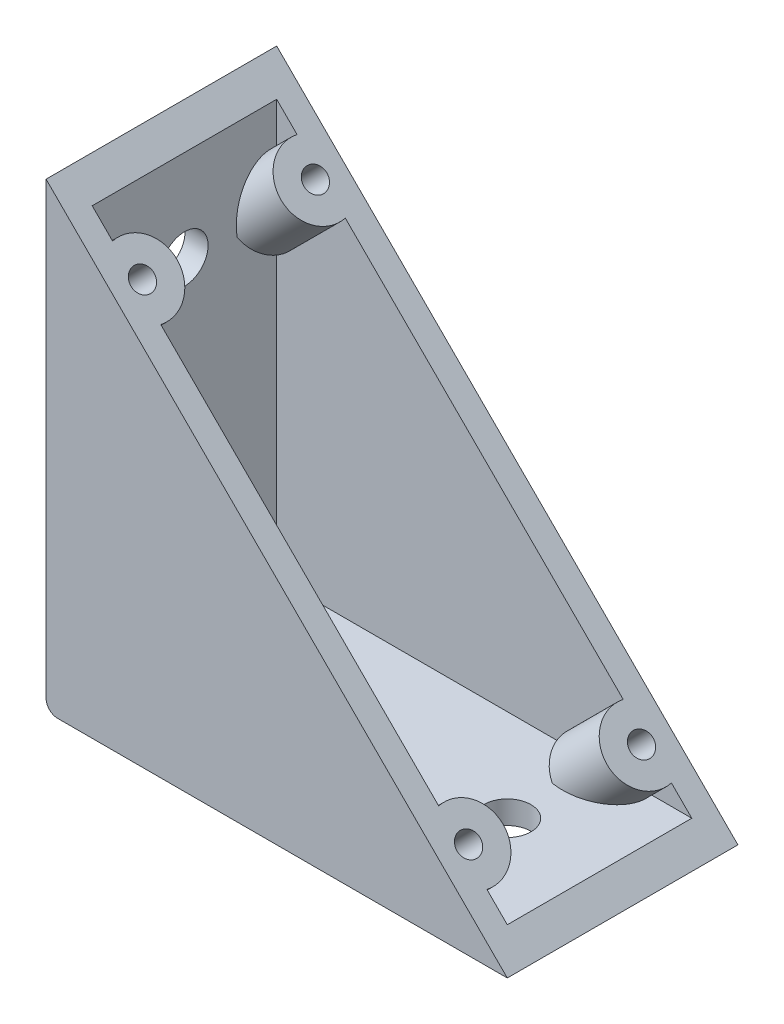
ISO-10303-21;
HEADER;
FILE_DESCRIPTION(('STEP AP214'),'2;1');
FILE_NAME('part.step','',(''),(''),'','','');
FILE_SCHEMA(('AUTOMOTIVE_DESIGN { 1 0 10303 214 1 1 1 1 }'));
ENDSEC;
DATA;
#1=APPLICATION_CONTEXT('core data for automotive mechanical design processes');
#2=APPLICATION_PROTOCOL_DEFINITION('international standard','automotive_design',2000,#1);
#3=PRODUCT_CONTEXT('',#1,'mechanical');
#4=PRODUCT('Part','Part','',(#3));
#5=PRODUCT_RELATED_PRODUCT_CATEGORY('part','',(#4));
#6=PRODUCT_DEFINITION_FORMATION('','',#4);
#7=PRODUCT_DEFINITION_CONTEXT('part definition',#1,'design');
#8=PRODUCT_DEFINITION('design','',#6,#7);
#9=PRODUCT_DEFINITION_SHAPE('','',#8);
#10=(LENGTH_UNIT() NAMED_UNIT(*) SI_UNIT(.MILLI.,.METRE.));
#11=(NAMED_UNIT(*) PLANE_ANGLE_UNIT() SI_UNIT($,.RADIAN.));
#12=(NAMED_UNIT(*) SI_UNIT($,.STERADIAN.) SOLID_ANGLE_UNIT());
#13=UNCERTAINTY_MEASURE_WITH_UNIT(LENGTH_MEASURE(1.E-05),#10,'distance_accuracy_value','');
#14=(GEOMETRIC_REPRESENTATION_CONTEXT(3) GLOBAL_UNCERTAINTY_ASSIGNED_CONTEXT((#13)) GLOBAL_UNIT_ASSIGNED_CONTEXT((#10,
#11,#12)) REPRESENTATION_CONTEXT('',''));
#15=CARTESIAN_POINT('',(0.,0.,0.));
#16=DIRECTION('',(0.,0.,1.));
#17=DIRECTION('',(1.,0.,0.));
#18=AXIS2_PLACEMENT_3D('',#15,#16,#17);
#19=CARTESIAN_POINT('',(0.,0.,40.));
#20=DIRECTION('',(0.,1.,0.));
#21=DIRECTION('',(0.,0.,1.));
#22=AXIS2_PLACEMENT_3D('',#19,#20,#21);
#23=PLANE('',#22);
#24=DIRECTION('',(-1.,0.,0.));
#25=VECTOR('',#24,1.);
#26=CARTESIAN_POINT('',(73.,0.,24.));
#27=LINE('',#26,#25);
#28=CARTESIAN_POINT('',(73.,0.,24.));
#29=VERTEX_POINT('',#28);
#30=CARTESIAN_POINT('',(71.,0.,24.));
#31=VERTEX_POINT('',#30);
#32=EDGE_CURVE('E295',#29,#31,#27,.T.);
#33=ORIENTED_EDGE('',*,*,#32,.F.);
#34=DIRECTION('',(0.,0.,1.));
#35=VECTOR('',#34,1.);
#36=CARTESIAN_POINT('',(73.,0.,16.));
#37=LINE('',#36,#35);
#38=CARTESIAN_POINT('',(73.,0.,16.));
#39=VERTEX_POINT('',#38);
#40=EDGE_CURVE('E308',#39,#29,#37,.T.);
#41=ORIENTED_EDGE('',*,*,#40,.F.);
#42=DIRECTION('',(1.,0.,0.));
#43=VECTOR('',#42,1.);
#44=CARTESIAN_POINT('',(71.,0.,16.));
#45=LINE('',#44,#43);
#46=CARTESIAN_POINT('',(71.,0.,16.));
#47=VERTEX_POINT('',#46);
#48=EDGE_CURVE('E317',#47,#39,#45,.T.);
#49=ORIENTED_EDGE('',*,*,#48,.F.);
#50=DIRECTION('',(0.,0.,-1.));
#51=VECTOR('',#50,1.);
#52=CARTESIAN_POINT('',(71.,0.,24.));
#53=LINE('',#52,#51);
#54=EDGE_CURVE('E298',#31,#47,#53,.T.);
#55=ORIENTED_EDGE('',*,*,#54,.F.);
#56=EDGE_LOOP('',(#33,#41,#49,#55));
#57=FACE_BOUND('',#56,.T.);
#58=CARTESIAN_POINT('',(20.,0.,20.));
#59=DIRECTION('',(0.,-1.,0.));
#60=DIRECTION('',(0.,0.,-1.));
#61=AXIS2_PLACEMENT_3D('',#58,#59,#60);
#62=CIRCLE('',#61,4.1);
#63=CARTESIAN_POINT('',(20.,0.,15.9));
#64=VERTEX_POINT('',#63);
#65=EDGE_CURVE('E399',#64,#64,#62,.T.);
#66=ORIENTED_EDGE('',*,*,#65,.F.);
#67=EDGE_LOOP('',(#66));
#68=FACE_BOUND('',#67,.T.);
#69=CARTESIAN_POINT('',(60.,0.,20.));
#70=DIRECTION('',(0.,-1.,0.));
#71=DIRECTION('',(0.,0.,-1.));
#72=AXIS2_PLACEMENT_3D('',#69,#70,#71);
#73=CIRCLE('',#72,4.09999999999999);
#74=CARTESIAN_POINT('',(60.,0.,15.9));
#75=VERTEX_POINT('',#74);
#76=EDGE_CURVE('E403',#75,#75,#73,.T.);
#77=ORIENTED_EDGE('',*,*,#76,.F.);
#78=EDGE_LOOP('',(#77));
#79=FACE_BOUND('',#78,.T.);
#80=DIRECTION('',(1.,0.,0.));
#81=VECTOR('',#80,1.);
#82=CARTESIAN_POINT('',(0.,0.,40.));
#83=LINE('',#82,#81);
#84=CARTESIAN_POINT('',(2.,0.,40.));
#85=VERTEX_POINT('',#84);
#86=CARTESIAN_POINT('',(80.,0.,40.));
#87=VERTEX_POINT('',#86);
#88=EDGE_CURVE('E751',#85,#87,#83,.T.);
#89=ORIENTED_EDGE('',*,*,#88,.F.);
#90=DIRECTION('',(0.,0.,-1.));
#91=VECTOR('',#90,1.);
#92=CARTESIAN_POINT('',(2.,0.,40.));
#93=LINE('',#92,#91);
#94=CARTESIAN_POINT('',(2.,0.,0.));
#95=VERTEX_POINT('',#94);
#96=EDGE_CURVE('E727',#85,#95,#93,.T.);
#97=ORIENTED_EDGE('',*,*,#96,.T.);
#98=DIRECTION('',(1.,0.,0.));
#99=VECTOR('',#98,1.);
#100=CARTESIAN_POINT('',(0.,0.,0.));
#101=LINE('',#100,#99);
#102=CARTESIAN_POINT('',(80.,0.,0.));
#103=VERTEX_POINT('',#102);
#104=EDGE_CURVE('E746',#95,#103,#101,.T.);
#105=ORIENTED_EDGE('',*,*,#104,.T.);
#106=DIRECTION('',(0.,0.,-1.));
#107=VECTOR('',#106,1.);
#108=CARTESIAN_POINT('',(80.,0.,40.));
#109=LINE('',#108,#107);
#110=EDGE_CURVE('E730',#87,#103,#109,.T.);
#111=ORIENTED_EDGE('',*,*,#110,.F.);
#112=EDGE_LOOP('',(#89,#97,#105,#111));
#113=FACE_BOUND('',#112,.T.);
#114=DIRECTION('',(-1.,0.,0.));
#115=VECTOR('',#114,1.);
#116=CARTESIAN_POINT('',(40.,0.,24.));
#117=LINE('',#116,#115);
#118=CARTESIAN_POINT('',(40.,0.,24.));
#119=VERTEX_POINT('',#118);
#120=CARTESIAN_POINT('',(38.,0.,24.));
#121=VERTEX_POINT('',#120);
#122=EDGE_CURVE('E294',#119,#121,#117,.T.);
#123=ORIENTED_EDGE('',*,*,#122,.F.);
#124=DIRECTION('',(0.,0.,1.));
#125=VECTOR('',#124,1.);
#126=CARTESIAN_POINT('',(40.,0.,24.));
#127=LINE('',#126,#125);
#128=CARTESIAN_POINT('',(40.,0.,16.));
#129=VERTEX_POINT('',#128);
#130=EDGE_CURVE('E291',#129,#119,#127,.T.);
#131=ORIENTED_EDGE('',*,*,#130,.F.);
#132=DIRECTION('',(1.,0.,0.));
#133=VECTOR('',#132,1.);
#134=CARTESIAN_POINT('',(40.,0.,16.));
#135=LINE('',#134,#133);
#136=CARTESIAN_POINT('',(38.,0.,16.));
#137=VERTEX_POINT('',#136);
#138=EDGE_CURVE('E1227',#137,#129,#135,.T.);
#139=ORIENTED_EDGE('',*,*,#138,.F.);
#140=DIRECTION('',(0.,0.,-1.));
#141=VECTOR('',#140,1.);
#142=CARTESIAN_POINT('',(38.,0.,16.));
#143=LINE('',#142,#141);
#144=EDGE_CURVE('E1229',#121,#137,#143,.T.);
#145=ORIENTED_EDGE('',*,*,#144,.F.);
#146=EDGE_LOOP('',(#123,#131,#139,#145));
#147=FACE_BOUND('',#146,.T.);
#148=ADVANCED_FACE('F31',(#57,#68,#79,#113,#147),#23,.F.);
#149=CARTESIAN_POINT('',(0.,0.,40.));
#150=DIRECTION('',(1.,0.,0.));
#151=DIRECTION('',(0.,0.,-1.));
#152=AXIS2_PLACEMENT_3D('',#149,#150,#151);
#153=PLANE('',#152);
#154=DIRECTION('',(0.,-1.,0.));
#155=VECTOR('',#154,1.);
#156=CARTESIAN_POINT('',(0.,38.,16.));
#157=LINE('',#156,#155);
#158=CARTESIAN_POINT('',(0.,40.,16.));
#159=VERTEX_POINT('',#158);
#160=CARTESIAN_POINT('',(0.,38.,16.));
#161=VERTEX_POINT('',#160);
#162=EDGE_CURVE('E366',#159,#161,#157,.T.);
#163=ORIENTED_EDGE('',*,*,#162,.F.);
#164=DIRECTION('',(0.,0.,-1.));
#165=VECTOR('',#164,1.);
#166=CARTESIAN_POINT('',(0.,40.,16.));
#167=LINE('',#166,#165);
#168=CARTESIAN_POINT('',(0.,40.,24.));
#169=VERTEX_POINT('',#168);
#170=EDGE_CURVE('E371',#169,#159,#167,.T.);
#171=ORIENTED_EDGE('',*,*,#170,.F.);
#172=DIRECTION('',(0.,1.,0.));
#173=VECTOR('',#172,1.);
#174=CARTESIAN_POINT('',(0.,40.,24.));
#175=LINE('',#174,#173);
#176=CARTESIAN_POINT('',(0.,38.,24.));
#177=VERTEX_POINT('',#176);
#178=EDGE_CURVE('E383',#177,#169,#175,.T.);
#179=ORIENTED_EDGE('',*,*,#178,.F.);
#180=DIRECTION('',(0.,0.,1.));
#181=VECTOR('',#180,1.);
#182=CARTESIAN_POINT('',(0.,38.,16.));
#183=LINE('',#182,#181);
#184=EDGE_CURVE('E380',#161,#177,#183,.T.);
#185=ORIENTED_EDGE('',*,*,#184,.F.);
#186=EDGE_LOOP('',(#163,#171,#179,#185));
#187=FACE_BOUND('',#186,.T.);
#188=CARTESIAN_POINT('',(0.,20.,19.9999999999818));
#189=DIRECTION('',(-1.,0.,0.));
#190=DIRECTION('',(0.,0.,1.));
#191=AXIS2_PLACEMENT_3D('',#188,#189,#190);
#192=CIRCLE('',#191,4.1);
#193=CARTESIAN_POINT('',(0.,20.,24.0999999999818));
#194=VERTEX_POINT('',#193);
#195=EDGE_CURVE('E407',#194,#194,#192,.T.);
#196=ORIENTED_EDGE('',*,*,#195,.F.);
#197=EDGE_LOOP('',(#196));
#198=FACE_BOUND('',#197,.T.);
#199=CARTESIAN_POINT('',(0.,60.,19.9999999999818));
#200=DIRECTION('',(-1.,0.,0.));
#201=DIRECTION('',(0.,0.,1.));
#202=AXIS2_PLACEMENT_3D('',#199,#200,#201);
#203=CIRCLE('',#202,4.09999999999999);
#204=CARTESIAN_POINT('',(0.,60.,24.0999999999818));
#205=VERTEX_POINT('',#204);
#206=EDGE_CURVE('E411',#205,#205,#203,.T.);
#207=ORIENTED_EDGE('',*,*,#206,.F.);
#208=EDGE_LOOP('',(#207));
#209=FACE_BOUND('',#208,.T.);
#210=DIRECTION('',(0.,-1.,0.));
#211=VECTOR('',#210,1.);
#212=CARTESIAN_POINT('',(0.,0.,0.));
#213=LINE('',#212,#211);
#214=CARTESIAN_POINT('',(0.,80.,0.));
#215=VERTEX_POINT('',#214);
#216=CARTESIAN_POINT('',(0.,2.,0.));
#217=VERTEX_POINT('',#216);
#218=EDGE_CURVE('E654',#215,#217,#213,.T.);
#219=ORIENTED_EDGE('',*,*,#218,.T.);
#220=DIRECTION('',(0.,0.,-1.));
#221=VECTOR('',#220,1.);
#222=CARTESIAN_POINT('',(0.,2.,40.));
#223=LINE('',#222,#221);
#224=CARTESIAN_POINT('',(0.,2.,40.));
#225=VERTEX_POINT('',#224);
#226=EDGE_CURVE('E39',#217,#225,#223,.F.);
#227=ORIENTED_EDGE('',*,*,#226,.T.);
#228=DIRECTION('',(0.,-1.,0.));
#229=VECTOR('',#228,1.);
#230=CARTESIAN_POINT('',(0.,0.,40.));
#231=LINE('',#230,#229);
#232=CARTESIAN_POINT('',(0.,80.,40.));
#233=VERTEX_POINT('',#232);
#234=EDGE_CURVE('E745',#233,#225,#231,.T.);
#235=ORIENTED_EDGE('',*,*,#234,.F.);
#236=DIRECTION('',(0.,0.,-1.));
#237=VECTOR('',#236,1.);
#238=CARTESIAN_POINT('',(0.,80.,40.));
#239=LINE('',#238,#237);
#240=EDGE_CURVE('E735',#233,#215,#239,.T.);
#241=ORIENTED_EDGE('',*,*,#240,.T.);
#242=EDGE_LOOP('',(#219,#227,#235,#241));
#243=FACE_BOUND('',#242,.T.);
#244=DIRECTION('',(0.,-1.,0.));
#245=VECTOR('',#244,1.);
#246=CARTESIAN_POINT('',(0.,71.,16.));
#247=LINE('',#246,#245);
#248=CARTESIAN_POINT('',(0.,73.,16.));
#249=VERTEX_POINT('',#248);
#250=CARTESIAN_POINT('',(0.,71.,16.));
#251=VERTEX_POINT('',#250);
#252=EDGE_CURVE('E333',#249,#251,#247,.T.);
#253=ORIENTED_EDGE('',*,*,#252,.F.);
#254=DIRECTION('',(0.,0.,-1.));
#255=VECTOR('',#254,1.);
#256=CARTESIAN_POINT('',(0.,73.,16.));
#257=LINE('',#256,#255);
#258=CARTESIAN_POINT('',(0.,73.,24.));
#259=VERTEX_POINT('',#258);
#260=EDGE_CURVE('E338',#259,#249,#257,.T.);
#261=ORIENTED_EDGE('',*,*,#260,.F.);
#262=DIRECTION('',(0.,1.,0.));
#263=VECTOR('',#262,1.);
#264=CARTESIAN_POINT('',(0.,73.,24.));
#265=LINE('',#264,#263);
#266=CARTESIAN_POINT('',(0.,71.,24.));
#267=VERTEX_POINT('',#266);
#268=EDGE_CURVE('E350',#267,#259,#265,.T.);
#269=ORIENTED_EDGE('',*,*,#268,.F.);
#270=DIRECTION('',(0.,0.,1.));
#271=VECTOR('',#270,1.);
#272=CARTESIAN_POINT('',(0.,71.,24.));
#273=LINE('',#272,#271);
#274=EDGE_CURVE('E347',#251,#267,#273,.T.);
#275=ORIENTED_EDGE('',*,*,#274,.F.);
#276=EDGE_LOOP('',(#253,#261,#269,#275));
#277=FACE_BOUND('',#276,.T.);
#278=ADVANCED_FACE('F640',(#187,#198,#209,#243,#277),#153,.F.);
#279=CARTESIAN_POINT('',(0.,80.,40.));
#280=DIRECTION('',(-0.707106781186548,-0.707106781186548,0.));
#281=DIRECTION('',(0.707106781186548,-0.707106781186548,0.));
#282=AXIS2_PLACEMENT_3D('',#279,#280,#281);
#283=PLANE('',#282);
#284=CARTESIAN_POINT('',(68.2842712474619,11.7157287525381,35.));
#285=DIRECTION('',(-0.707106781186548,-0.707106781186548,0.));
#286=DIRECTION('',(0.707106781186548,-0.707106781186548,0.));
#287=AXIS2_PLACEMENT_3D('',#284,#285,#286);
#288=CIRCLE('',#287,6.);
#289=CARTESIAN_POINT('',(72.4675713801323,7.53242861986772,36.));
#290=VERTEX_POINT('',#289);
#291=CARTESIAN_POINT('',(64.1009711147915,15.8990288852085,36.));
#292=VERTEX_POINT('',#291);
#293=EDGE_CURVE('E461',#290,#292,#288,.F.);
#294=ORIENTED_EDGE('',*,*,#293,.T.);
#295=DIRECTION('',(-0.707106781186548,0.707106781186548,0.));
#296=VECTOR('',#295,1.);
#297=CARTESIAN_POINT('',(40.,40.,36.));
#298=LINE('',#297,#296);
#299=CARTESIAN_POINT('',(15.8990288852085,64.1009711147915,36.));
#300=VERTEX_POINT('',#299);
#301=EDGE_CURVE('E444',#292,#300,#298,.T.);
#302=ORIENTED_EDGE('',*,*,#301,.T.);
#303=CARTESIAN_POINT('',(11.7157287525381,68.2842712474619,35.));
#304=DIRECTION('',(-0.707106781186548,-0.707106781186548,0.));
#305=DIRECTION('',(0.707106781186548,-0.707106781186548,0.));
#306=AXIS2_PLACEMENT_3D('',#303,#304,#305);
#307=CIRCLE('',#306,6.);
#308=CARTESIAN_POINT('',(7.53242861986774,72.4675713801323,36.));
#309=VERTEX_POINT('',#308);
#310=EDGE_CURVE('E455',#300,#309,#307,.F.);
#311=ORIENTED_EDGE('',*,*,#310,.T.);
#312=CARTESIAN_POINT('',(4.,76.,36.));
#313=VERTEX_POINT('',#312);
#314=EDGE_CURVE('E441',#309,#313,#298,.T.);
#315=ORIENTED_EDGE('',*,*,#314,.T.);
#316=DIRECTION('',(0.,0.,-1.));
#317=VECTOR('',#316,1.);
#318=CARTESIAN_POINT('',(4.,76.,40.));
#319=LINE('',#318,#317);
#320=CARTESIAN_POINT('',(4.,76.,4.));
#321=VERTEX_POINT('',#320);
#322=EDGE_CURVE('E438',#313,#321,#319,.T.);
#323=ORIENTED_EDGE('',*,*,#322,.T.);
#324=DIRECTION('',(-0.707106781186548,0.707106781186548,0.));
#325=VECTOR('',#324,1.);
#326=CARTESIAN_POINT('',(40.,40.,4.));
#327=LINE('',#326,#325);
#328=CARTESIAN_POINT('',(7.53242861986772,72.4675713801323,4.));
#329=VERTEX_POINT('',#328);
#330=EDGE_CURVE('E433',#329,#321,#327,.T.);
#331=ORIENTED_EDGE('',*,*,#330,.F.);
#332=CARTESIAN_POINT('',(11.7157287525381,68.2842712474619,5.));
#333=DIRECTION('',(-0.707106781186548,-0.707106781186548,0.));
#334=DIRECTION('',(0.707106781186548,-0.707106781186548,0.));
#335=AXIS2_PLACEMENT_3D('',#332,#333,#334);
#336=CIRCLE('',#335,6.);
#337=CARTESIAN_POINT('',(15.8990288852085,64.1009711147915,4.));
#338=VERTEX_POINT('',#337);
#339=EDGE_CURVE('E454',#329,#338,#336,.F.);
#340=ORIENTED_EDGE('',*,*,#339,.T.);
#341=CARTESIAN_POINT('',(64.1009711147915,15.8990288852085,4.));
#342=VERTEX_POINT('',#341);
#343=EDGE_CURVE('E450',#342,#338,#327,.T.);
#344=ORIENTED_EDGE('',*,*,#343,.F.);
#345=CARTESIAN_POINT('',(68.2842712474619,11.7157287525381,5.));
#346=DIRECTION('',(-0.707106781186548,-0.707106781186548,0.));
#347=DIRECTION('',(0.707106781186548,-0.707106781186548,0.));
#348=AXIS2_PLACEMENT_3D('',#345,#346,#347);
#349=CIRCLE('',#348,6.);
#350=CARTESIAN_POINT('',(72.4675713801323,7.53242861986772,4.));
#351=VERTEX_POINT('',#350);
#352=EDGE_CURVE('E467',#342,#351,#349,.F.);
#353=ORIENTED_EDGE('',*,*,#352,.T.);
#354=CARTESIAN_POINT('',(76.,4.,4.));
#355=VERTEX_POINT('',#354);
#356=EDGE_CURVE('E447',#355,#351,#327,.T.);
#357=ORIENTED_EDGE('',*,*,#356,.F.);
#358=DIRECTION('',(0.,0.,-1.));
#359=VECTOR('',#358,1.);
#360=CARTESIAN_POINT('',(76.,4.,40.));
#361=LINE('',#360,#359);
#362=CARTESIAN_POINT('',(76.,4.,36.));
#363=VERTEX_POINT('',#362);
#364=EDGE_CURVE('E424',#363,#355,#361,.T.);
#365=ORIENTED_EDGE('',*,*,#364,.F.);
#366=EDGE_CURVE('E437',#363,#290,#298,.T.);
#367=ORIENTED_EDGE('',*,*,#366,.T.);
#368=EDGE_LOOP('',(#294,#302,#311,#315,#323,#331,#340,#344,#353,#357,#365,#367));
#369=FACE_BOUND('',#368,.T.);
#370=CARTESIAN_POINT('',(11.7157287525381,68.2842712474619,35.));
#371=DIRECTION('',(0.707106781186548,0.707106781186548,0.));
#372=DIRECTION('',(-0.707106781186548,0.707106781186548,0.));
#373=AXIS2_PLACEMENT_3D('',#370,#371,#372);
#374=CIRCLE('',#373,2.);
#375=CARTESIAN_POINT('',(10.301515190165,69.698484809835,35.));
#376=VERTEX_POINT('',#375);
#377=EDGE_CURVE('E583',#376,#376,#374,.T.);
#378=ORIENTED_EDGE('',*,*,#377,.F.);
#379=EDGE_LOOP('',(#378));
#380=FACE_BOUND('',#379,.T.);
#381=CARTESIAN_POINT('',(11.7157287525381,68.2842712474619,5.));
#382=DIRECTION('',(0.707106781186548,0.707106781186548,0.));
#383=DIRECTION('',(-0.707106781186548,0.707106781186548,0.));
#384=AXIS2_PLACEMENT_3D('',#381,#382,#383);
#385=CIRCLE('',#384,2.);
#386=CARTESIAN_POINT('',(10.301515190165,69.698484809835,5.));
#387=VERTEX_POINT('',#386);
#388=EDGE_CURVE('E768',#387,#387,#385,.T.);
#389=ORIENTED_EDGE('',*,*,#388,.F.);
#390=EDGE_LOOP('',(#389));
#391=FACE_BOUND('',#390,.T.);
#392=CARTESIAN_POINT('',(68.2842712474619,11.7157287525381,35.));
#393=DIRECTION('',(0.707106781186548,0.707106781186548,0.));
#394=DIRECTION('',(-0.707106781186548,0.707106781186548,0.));
#395=AXIS2_PLACEMENT_3D('',#392,#393,#394);
#396=CIRCLE('',#395,2.);
#397=CARTESIAN_POINT('',(66.8700576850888,13.1299423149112,35.));
#398=VERTEX_POINT('',#397);
#399=EDGE_CURVE('E762',#398,#398,#396,.T.);
#400=ORIENTED_EDGE('',*,*,#399,.F.);
#401=EDGE_LOOP('',(#400));
#402=FACE_BOUND('',#401,.T.);
#403=CARTESIAN_POINT('',(68.2842712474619,11.7157287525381,5.));
#404=DIRECTION('',(0.707106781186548,0.707106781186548,0.));
#405=DIRECTION('',(-0.707106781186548,0.707106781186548,0.));
#406=AXIS2_PLACEMENT_3D('',#403,#404,#405);
#407=CIRCLE('',#406,2.);
#408=CARTESIAN_POINT('',(66.8700576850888,13.1299423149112,5.));
#409=VERTEX_POINT('',#408);
#410=EDGE_CURVE('E756',#409,#409,#407,.T.);
#411=ORIENTED_EDGE('',*,*,#410,.F.);
#412=EDGE_LOOP('',(#411));
#413=FACE_BOUND('',#412,.T.);
#414=DIRECTION('',(-0.707106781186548,0.707106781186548,0.));
#415=VECTOR('',#414,1.);
#416=CARTESIAN_POINT('',(0.,80.,0.));
#417=LINE('',#416,#415);
#418=EDGE_CURVE('E743',#103,#215,#417,.T.);
#419=ORIENTED_EDGE('',*,*,#418,.T.);
#420=ORIENTED_EDGE('',*,*,#240,.F.);
#421=DIRECTION('',(-0.707106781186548,0.707106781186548,0.));
#422=VECTOR('',#421,1.);
#423=CARTESIAN_POINT('',(0.,80.,40.));
#424=LINE('',#423,#422);
#425=EDGE_CURVE('E740',#87,#233,#424,.T.);
#426=ORIENTED_EDGE('',*,*,#425,.F.);
#427=ORIENTED_EDGE('',*,*,#110,.T.);
#428=EDGE_LOOP('',(#419,#420,#426,#427));
#429=FACE_BOUND('',#428,.T.);
#430=ADVANCED_FACE('F634',(#369,#380,#391,#402,#413,#429),#283,.F.);
#431=CARTESIAN_POINT('',(0.,0.,40.));
#432=DIRECTION('',(0.,0.,-1.));
#433=DIRECTION('',(-1.,0.,0.));
#434=AXIS2_PLACEMENT_3D('',#431,#432,#433);
#435=PLANE('',#434);
#436=ORIENTED_EDGE('',*,*,#234,.T.);
#437=CARTESIAN_POINT('',(2.,2.,40.));
#438=DIRECTION('',(0.,0.,-1.));
#439=DIRECTION('',(-1.,0.,0.));
#440=AXIS2_PLACEMENT_3D('',#437,#438,#439);
#441=CIRCLE('',#440,2.);
#442=EDGE_CURVE('E11',#225,#85,#441,.F.);
#443=ORIENTED_EDGE('',*,*,#442,.T.);
#444=ORIENTED_EDGE('',*,*,#88,.T.);
#445=ORIENTED_EDGE('',*,*,#425,.T.);
#446=EDGE_LOOP('',(#436,#443,#444,#445));
#447=FACE_BOUND('',#446,.T.);
#448=ADVANCED_FACE('F631',(#447),#435,.F.);
#449=CARTESIAN_POINT('',(0.,0.,0.));
#450=DIRECTION('',(0.,0.,-1.));
#451=DIRECTION('',(-1.,0.,0.));
#452=AXIS2_PLACEMENT_3D('',#449,#450,#451);
#453=PLANE('',#452);
#454=ORIENTED_EDGE('',*,*,#104,.F.);
#455=CARTESIAN_POINT('',(2.,2.,0.));
#456=DIRECTION('',(0.,0.,-1.));
#457=DIRECTION('',(-1.,0.,0.));
#458=AXIS2_PLACEMENT_3D('',#455,#456,#457);
#459=CIRCLE('',#458,2.);
#460=EDGE_CURVE('E53',#95,#217,#459,.T.);
#461=ORIENTED_EDGE('',*,*,#460,.T.);
#462=ORIENTED_EDGE('',*,*,#218,.F.);
#463=ORIENTED_EDGE('',*,*,#418,.F.);
#464=EDGE_LOOP('',(#454,#461,#462,#463));
#465=FACE_BOUND('',#464,.T.);
#466=ADVANCED_FACE('F629',(#465),#453,.T.);
#467=CARTESIAN_POINT('',(61.2132034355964,4.64466094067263,5.));
#468=DIRECTION('',(0.707106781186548,0.707106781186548,0.));
#469=DIRECTION('',(-0.707106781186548,0.707106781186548,0.));
#470=AXIS2_PLACEMENT_3D('',#467,#468,#469);
#471=CONICAL_SURFACE('',#470,2.,1.02974425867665);
#472=CARTESIAN_POINT('',(60.3634581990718,3.79491570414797,5.));
#473=VERTEX_POINT('',#472);
#474=VERTEX_LOOP('',#473);
#475=FACE_BOUND('',#474,.T.);
#476=CARTESIAN_POINT('',(61.2132034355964,4.64466094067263,5.));
#477=DIRECTION('',(0.707106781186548,0.707106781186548,0.));
#478=DIRECTION('',(-0.707106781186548,0.707106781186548,0.));
#479=AXIS2_PLACEMENT_3D('',#476,#477,#478);
#480=CIRCLE('',#479,2.);
#481=CARTESIAN_POINT('',(59.7989898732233,6.05887450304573,5.));
#482=VERTEX_POINT('',#481);
#483=EDGE_CURVE('E749',#482,#482,#480,.T.);
#484=ORIENTED_EDGE('',*,*,#483,.T.);
#485=EDGE_LOOP('',(#484));
#486=FACE_BOUND('',#485,.T.);
#487=ADVANCED_FACE('F625',(#475,#486),#471,.F.);
#488=CARTESIAN_POINT('',(68.2842712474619,11.7157287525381,5.));
#489=DIRECTION('',(0.707106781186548,0.707106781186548,0.));
#490=DIRECTION('',(-0.707106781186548,0.707106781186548,0.));
#491=AXIS2_PLACEMENT_3D('',#488,#489,#490);
#492=CYLINDRICAL_SURFACE('',#491,2.);
#493=ORIENTED_EDGE('',*,*,#483,.F.);
#494=EDGE_LOOP('',(#493));
#495=FACE_BOUND('',#494,.T.);
#496=ORIENTED_EDGE('',*,*,#410,.T.);
#497=EDGE_LOOP('',(#496));
#498=FACE_BOUND('',#497,.T.);
#499=ADVANCED_FACE('F621',(#495,#498),#492,.F.);
#500=CARTESIAN_POINT('',(61.2132034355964,4.64466094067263,35.));
#501=DIRECTION('',(0.707106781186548,0.707106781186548,0.));
#502=DIRECTION('',(-0.707106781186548,0.707106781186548,0.));
#503=AXIS2_PLACEMENT_3D('',#500,#501,#502);
#504=CONICAL_SURFACE('',#503,1.99999999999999,1.02974425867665);
#505=CARTESIAN_POINT('',(60.3634581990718,3.79491570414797,35.));
#506=VERTEX_POINT('',#505);
#507=VERTEX_LOOP('',#506);
#508=FACE_BOUND('',#507,.T.);
#509=CARTESIAN_POINT('',(61.2132034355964,4.64466094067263,35.));
#510=DIRECTION('',(0.707106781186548,0.707106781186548,0.));
#511=DIRECTION('',(-0.707106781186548,0.707106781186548,0.));
#512=AXIS2_PLACEMENT_3D('',#509,#510,#511);
#513=CIRCLE('',#512,2.);
#514=CARTESIAN_POINT('',(59.7989898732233,6.05887450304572,35.));
#515=VERTEX_POINT('',#514);
#516=EDGE_CURVE('E759',#515,#515,#513,.T.);
#517=ORIENTED_EDGE('',*,*,#516,.T.);
#518=EDGE_LOOP('',(#517));
#519=FACE_BOUND('',#518,.T.);
#520=ADVANCED_FACE('F617',(#508,#519),#504,.F.);
#521=CARTESIAN_POINT('',(68.2842712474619,11.7157287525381,35.));
#522=DIRECTION('',(0.707106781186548,0.707106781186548,0.));
#523=DIRECTION('',(-0.707106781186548,0.707106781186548,0.));
#524=AXIS2_PLACEMENT_3D('',#521,#522,#523);
#525=CYLINDRICAL_SURFACE('',#524,2.);
#526=ORIENTED_EDGE('',*,*,#516,.F.);
#527=EDGE_LOOP('',(#526));
#528=FACE_BOUND('',#527,.T.);
#529=ORIENTED_EDGE('',*,*,#399,.T.);
#530=EDGE_LOOP('',(#529));
#531=FACE_BOUND('',#530,.T.);
#532=ADVANCED_FACE('F613',(#528,#531),#525,.F.);
#533=CARTESIAN_POINT('',(4.64466094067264,61.2132034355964,5.));
#534=DIRECTION('',(0.707106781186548,0.707106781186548,0.));
#535=DIRECTION('',(-0.707106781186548,0.707106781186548,0.));
#536=AXIS2_PLACEMENT_3D('',#533,#534,#535);
#537=CONICAL_SURFACE('',#536,2.,1.02974425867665);
#538=CARTESIAN_POINT('',(3.79491570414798,60.3634581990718,5.));
#539=VERTEX_POINT('',#538);
#540=VERTEX_LOOP('',#539);
#541=FACE_BOUND('',#540,.T.);
#542=CARTESIAN_POINT('',(4.64466094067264,61.2132034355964,5.));
#543=DIRECTION('',(0.707106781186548,0.707106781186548,0.));
#544=DIRECTION('',(-0.707106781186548,0.707106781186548,0.));
#545=AXIS2_PLACEMENT_3D('',#542,#543,#544);
#546=CIRCLE('',#545,2.);
#547=CARTESIAN_POINT('',(3.23044737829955,62.6274169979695,5.));
#548=VERTEX_POINT('',#547);
#549=EDGE_CURVE('E765',#548,#548,#546,.T.);
#550=ORIENTED_EDGE('',*,*,#549,.T.);
#551=EDGE_LOOP('',(#550));
#552=FACE_BOUND('',#551,.T.);
#553=ADVANCED_FACE('F609',(#541,#552),#537,.F.);
#554=CARTESIAN_POINT('',(11.7157287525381,68.2842712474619,5.));
#555=DIRECTION('',(0.707106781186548,0.707106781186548,0.));
#556=DIRECTION('',(-0.707106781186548,0.707106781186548,0.));
#557=AXIS2_PLACEMENT_3D('',#554,#555,#556);
#558=CYLINDRICAL_SURFACE('',#557,2.);
#559=ORIENTED_EDGE('',*,*,#549,.F.);
#560=EDGE_LOOP('',(#559));
#561=FACE_BOUND('',#560,.T.);
#562=ORIENTED_EDGE('',*,*,#388,.T.);
#563=EDGE_LOOP('',(#562));
#564=FACE_BOUND('',#563,.T.);
#565=ADVANCED_FACE('F605',(#561,#564),#558,.F.);
#566=CARTESIAN_POINT('',(4.64466094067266,61.2132034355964,35.));
#567=DIRECTION('',(0.707106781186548,0.707106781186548,0.));
#568=DIRECTION('',(-0.707106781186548,0.707106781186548,0.));
#569=AXIS2_PLACEMENT_3D('',#566,#567,#568);
#570=CONICAL_SURFACE('',#569,1.99999999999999,1.02974425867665);
#571=CARTESIAN_POINT('',(3.79491570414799,60.3634581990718,35.));
#572=VERTEX_POINT('',#571);
#573=VERTEX_LOOP('',#572);
#574=FACE_BOUND('',#573,.T.);
#575=CARTESIAN_POINT('',(4.64466094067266,61.2132034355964,35.));
#576=DIRECTION('',(0.707106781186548,0.707106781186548,0.));
#577=DIRECTION('',(-0.707106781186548,0.707106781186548,0.));
#578=AXIS2_PLACEMENT_3D('',#575,#576,#577);
#579=CIRCLE('',#578,2.);
#580=CARTESIAN_POINT('',(3.23044737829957,62.6274169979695,35.));
#581=VERTEX_POINT('',#580);
#582=EDGE_CURVE('E770',#581,#581,#579,.T.);
#583=ORIENTED_EDGE('',*,*,#582,.T.);
#584=EDGE_LOOP('',(#583));
#585=FACE_BOUND('',#584,.T.);
#586=ADVANCED_FACE('F601',(#574,#585),#570,.F.);
#587=CARTESIAN_POINT('',(11.7157287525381,68.2842712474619,35.));
#588=DIRECTION('',(0.707106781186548,0.707106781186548,0.));
#589=DIRECTION('',(-0.707106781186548,0.707106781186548,0.));
#590=AXIS2_PLACEMENT_3D('',#587,#588,#589);
#591=CYLINDRICAL_SURFACE('',#590,2.);
#592=ORIENTED_EDGE('',*,*,#582,.F.);
#593=EDGE_LOOP('',(#592));
#594=FACE_BOUND('',#593,.T.);
#595=ORIENTED_EDGE('',*,*,#377,.T.);
#596=EDGE_LOOP('',(#595));
#597=FACE_BOUND('',#596,.T.);
#598=ADVANCED_FACE('F571',(#594,#597),#591,.F.);
#599=CARTESIAN_POINT('',(4.,0.,40.));
#600=DIRECTION('',(1.,0.,0.));
#601=DIRECTION('',(0.,0.,-1.));
#602=AXIS2_PLACEMENT_3D('',#599,#600,#601);
#603=PLANE('',#602);
#604=CARTESIAN_POINT('',(4.,20.,19.9999999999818));
#605=DIRECTION('',(1.,0.,0.));
#606=DIRECTION('',(0.,0.,-1.));
#607=AXIS2_PLACEMENT_3D('',#604,#605,#606);
#608=CIRCLE('',#607,4.09999999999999);
#609=CARTESIAN_POINT('',(4.,20.,15.8999999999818));
#610=VERTEX_POINT('',#609);
#611=EDGE_CURVE('E410',#610,#610,#608,.T.);
#612=ORIENTED_EDGE('',*,*,#611,.F.);
#613=EDGE_LOOP('',(#612));
#614=FACE_BOUND('',#613,.T.);
#615=CARTESIAN_POINT('',(4.,60.,19.9999999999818));
#616=DIRECTION('',(1.,0.,0.));
#617=DIRECTION('',(0.,0.,-1.));
#618=AXIS2_PLACEMENT_3D('',#615,#616,#617);
#619=CIRCLE('',#618,4.09999999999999);
#620=CARTESIAN_POINT('',(4.,60.,15.8999999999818));
#621=VERTEX_POINT('',#620);
#622=EDGE_CURVE('E414',#621,#621,#619,.T.);
#623=ORIENTED_EDGE('',*,*,#622,.F.);
#624=EDGE_LOOP('',(#623));
#625=FACE_BOUND('',#624,.T.);
#626=CARTESIAN_POINT('',(4.,71.8850685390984,14.9727909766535));
#627=CARTESIAN_POINT('',(4.,71.3587579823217,15.4911392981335));
#628=CARTESIAN_POINT('',(4.,70.8332662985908,16.0103244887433));
#629=CARTESIAN_POINT('',(4.,69.7840512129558,17.0514237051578));
#630=CARTESIAN_POINT('',(4.,69.2603298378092,17.5733397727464));
#631=CARTESIAN_POINT('',(4.,68.2032512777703,18.6325341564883));
#632=CARTESIAN_POINT('',(4.,67.6699631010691,19.1698814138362));
#633=CARTESIAN_POINT('',(4.,66.6078431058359,20.2480303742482));
#634=CARTESIAN_POINT('',(4.,66.0790077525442,20.7888285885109));
#635=CARTESIAN_POINT('',(4.,65.1611958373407,21.7369182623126));
#636=CARTESIAN_POINT('',(4.,64.7709987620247,22.1430272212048));
#637=CARTESIAN_POINT('',(4.,63.994528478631,22.9590366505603));
#638=CARTESIAN_POINT('',(4.,63.6082555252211,23.3689373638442));
#639=CARTESIAN_POINT('',(4.,62.8396973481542,24.1949999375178));
#640=CARTESIAN_POINT('',(4.,62.4574295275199,24.6111780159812));
#641=CARTESIAN_POINT('',(4.,61.7002105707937,25.4500087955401));
#642=CARTESIAN_POINT('',(4.,61.3252578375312,25.8726600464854));
#643=CARTESIAN_POINT('',(4.,60.7736424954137,26.5098929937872));
#644=CARTESIAN_POINT('',(4.,60.5930416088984,26.7210650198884));
#645=CARTESIAN_POINT('',(4.,60.2349068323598,27.1459907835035));
#646=CARTESIAN_POINT('',(4.,60.0573728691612,27.3597444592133));
#647=CARTESIAN_POINT('',(4.,59.7058766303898,27.7905345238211));
#648=CARTESIAN_POINT('',(4.,59.5319181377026,28.0075740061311));
#649=CARTESIAN_POINT('',(4.,59.1886778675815,28.4453185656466));
#650=CARTESIAN_POINT('',(4.,59.0193959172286,28.6660235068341));
#651=CARTESIAN_POINT('',(4.,58.6877137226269,29.1105224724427));
#652=CARTESIAN_POINT('',(4.,58.5252785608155,29.3342903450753));
#653=CARTESIAN_POINT('',(4.,58.20783227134,29.7871249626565));
#654=CARTESIAN_POINT('',(4.,58.0528225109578,30.0161926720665));
#655=CARTESIAN_POINT('',(4.,57.7527896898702,30.4802112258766));
#656=CARTESIAN_POINT('',(4.,57.6077487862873,30.7151504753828));
#657=CARTESIAN_POINT('',(4.,57.3304812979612,31.1924317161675));
#658=CARTESIAN_POINT('',(4.,57.1982478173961,31.4347696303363));
#659=CARTESIAN_POINT('',(4.,57.0473867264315,31.7355298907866));
#660=CARTESIAN_POINT('',(4.,57.0206265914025,31.7899068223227));
#661=CARTESIAN_POINT('',(4.,56.9679855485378,31.8990890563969));
#662=CARTESIAN_POINT('',(4.,56.9421046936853,31.9538943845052));
#663=CARTESIAN_POINT('',(4.,56.8658535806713,32.1189903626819));
#664=CARTESIAN_POINT('',(4.,56.8168877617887,32.2299352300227));
#665=CARTESIAN_POINT('',(4.,56.7231939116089,32.453625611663));
#666=CARTESIAN_POINT('',(4.,56.6784665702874,32.5663714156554));
#667=CARTESIAN_POINT('',(4.,56.5938025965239,32.793649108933));
#668=CARTESIAN_POINT('',(4.,56.5538656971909,32.908180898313));
#669=CARTESIAN_POINT('',(4.,56.4802582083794,33.1361882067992));
#670=CARTESIAN_POINT('',(4.,56.4464592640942,33.2496221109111));
#671=CARTESIAN_POINT('',(4.,56.3845104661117,33.4780312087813));
#672=CARTESIAN_POINT('',(4.,56.3563606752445,33.593006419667));
#673=CARTESIAN_POINT('',(4.,56.306237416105,33.8242762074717));
#674=CARTESIAN_POINT('',(4.,56.284262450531,33.9405704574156));
#675=CARTESIAN_POINT('',(4.,56.2469324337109,34.1742171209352));
#676=CARTESIAN_POINT('',(4.,56.2315775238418,34.2915695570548));
#677=CARTESIAN_POINT('',(4.,56.2018225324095,34.5868140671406));
#678=CARTESIAN_POINT('',(4.,56.1918692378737,34.7651787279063));
#679=CARTESIAN_POINT('',(4.,56.1884171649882,35.1219976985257));
#680=CARTESIAN_POINT('',(4.,56.194913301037,35.3004519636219));
#681=CARTESIAN_POINT('',(4.,56.2240309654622,35.6566557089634));
#682=CARTESIAN_POINT('',(4.,56.2467089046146,35.8344005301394));
#683=CARTESIAN_POINT('',(4.,56.3070671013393,36.1873296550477));
#684=CARTESIAN_POINT('',(4.,56.3447517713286,36.3625131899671));
#685=CARTESIAN_POINT('',(4.,56.4523071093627,36.7832942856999));
#686=CARTESIAN_POINT('',(4.,56.5290501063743,37.0271320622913));
#687=CARTESIAN_POINT('',(4.,56.7041478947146,37.5068986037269));
#688=CARTESIAN_POINT('',(4.,56.8025155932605,37.7428225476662));
#689=CARTESIAN_POINT('',(4.,56.9632309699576,38.0923252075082));
#690=CARTESIAN_POINT('',(4.,57.0193926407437,38.2088144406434));
#691=CARTESIAN_POINT('',(4.,57.1354701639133,38.4399132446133));
#692=CARTESIAN_POINT('',(4.,57.1953860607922,38.5545227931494));
#693=CARTESIAN_POINT('',(4.,57.318465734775,38.7819189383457));
#694=CARTESIAN_POINT('',(4.,57.3816282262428,38.8947062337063));
#695=CARTESIAN_POINT('',(4.,57.5108131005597,39.1186203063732));
#696=CARTESIAN_POINT('',(4.,57.5768353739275,39.2297471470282));
#697=CARTESIAN_POINT('',(4.,57.7880268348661,39.5762170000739));
#698=CARTESIAN_POINT('',(4.,57.9376715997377,39.8088376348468));
#699=CARTESIAN_POINT('',(4.,58.2456690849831,40.268265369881));
#700=CARTESIAN_POINT('',(4.,58.4040239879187,40.4950709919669));
#701=CARTESIAN_POINT('',(4.,58.7276026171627,40.9440183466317));
#702=CARTESIAN_POINT('',(4.,58.8928323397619,41.1661557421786));
#703=CARTESIAN_POINT('',(4.,59.2285692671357,41.6063591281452));
#704=CARTESIAN_POINT('',(4.,59.399076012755,41.8244254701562));
#705=CARTESIAN_POINT('',(4.,59.7450390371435,42.2580891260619));
#706=CARTESIAN_POINT('',(4.,59.9205131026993,42.4736722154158));
#707=CARTESIAN_POINT('',(4.,60.2749162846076,42.9019788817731));
#708=CARTESIAN_POINT('',(4.,60.4538454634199,43.1147024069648));
#709=CARTESIAN_POINT('',(4.,60.9946688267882,43.7490631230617));
#710=CARTESIAN_POINT('',(4.,61.3607751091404,44.16710870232));
#711=CARTESIAN_POINT('',(4.,62.0600525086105,44.9506139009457));
#712=CARTESIAN_POINT('',(4.,62.3924160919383,45.3167991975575));
#713=CARTESIAN_POINT('',(4.,63.0618329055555,46.0449440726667));
#714=CARTESIAN_POINT('',(4.,63.3988867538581,46.4069030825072));
#715=CARTESIAN_POINT('',(4.,64.0735657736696,47.1243026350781));
#716=CARTESIAN_POINT('',(4.,64.4111598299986,47.479772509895));
#717=CARTESIAN_POINT('',(4.,65.0890701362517,48.1879768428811));
#718=CARTESIAN_POINT('',(4.,65.4293858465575,48.5407118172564));
#719=CARTESIAN_POINT('',(4.,65.7707440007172,48.8924252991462));
#720=B_SPLINE_CURVE_WITH_KNOTS('',3,(#626,#627,#628,#629,#630,#631,#632,#633,#634,#635,#636,
#637,#638,#639,#640,#641,#642,#643,#644,#645,#646,#647,#648,#649,#650,#651,#652,#653,#654,#655,
#656,#657,#658,#659,#660,#661,#662,#663,#664,#665,#666,#667,#668,#669,#670,#671,#672,#673,#674,
#675,#676,#677,#678,#679,#680,#681,#682,#683,#684,#685,#686,#687,#688,#689,#690,#691,#692,#693,
#694,#695,#696,#697,#698,#699,#700,#701,#702,#703,#704,#705,#706,#707,#708,#709,#710,#711,#712,
#713,#714,#715,#716,#717,#718,#719),.UNSPECIFIED.,.F.,.F.,(4,2,2,2,2,2,2,2,2,2,2,2,2,2,2,2,2,2,
2,2,2,2,2,2,2,2,2,2,2,2,2,2,2,2,2,2,2,2,2,2,2,2,2,2,2,2,4),(0.,2.21612533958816,
4.43425307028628,6.70541553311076,8.9745624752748,10.6641007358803,12.3537479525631,
14.0489805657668,15.7438388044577,16.577418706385,17.4109786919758,18.2453793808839,
19.0797491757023,19.9091605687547,20.738724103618,21.5667619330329,22.3943514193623,
22.5761604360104,22.7579803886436,23.1217068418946,23.4854924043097,23.8492576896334,
24.2042115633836,24.5591693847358,24.914041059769,25.2689203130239,25.8040607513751,
26.3390357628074,26.8758848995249,27.412892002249,28.1784224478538,28.9444110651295,
29.3323191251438,29.7202317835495,30.1079919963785,30.4957373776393,31.3252372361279,
32.1549459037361,32.985394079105,33.8157701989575,34.6496354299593,35.4835157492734,
37.1504350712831,38.6339752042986,40.1177127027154,41.5883964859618,43.0587955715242),.UNSPECIFIED.);
#721=CARTESIAN_POINT('',(4.,58.6573702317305,29.1541715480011));
#722=VERTEX_POINT('',#721);
#723=CARTESIAN_POINT('',(3.99999999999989,56.2750393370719,36.));
#724=VERTEX_POINT('',#723);
#725=EDGE_CURVE('E577',#722,#724,#720,.T.);
#726=ORIENTED_EDGE('',*,*,#725,.T.);
#727=DIRECTION('',(0.,-1.,0.));
#728=VECTOR('',#727,1.);
#729=CARTESIAN_POINT('',(4.,0.,36.));
#730=LINE('',#729,#728);
#731=CARTESIAN_POINT('',(4.,4.,36.));
#732=VERTEX_POINT('',#731);
#733=EDGE_CURVE('E429',#724,#732,#730,.T.);
#734=ORIENTED_EDGE('',*,*,#733,.T.);
#735=DIRECTION('',(0.,0.,-1.));
#736=VECTOR('',#735,1.);
#737=CARTESIAN_POINT('',(4.,4.,40.));
#738=LINE('',#737,#736);
#739=CARTESIAN_POINT('',(4.,4.,4.));
#740=VERTEX_POINT('',#739);
#741=EDGE_CURVE('E420',#732,#740,#738,.T.);
#742=ORIENTED_EDGE('',*,*,#741,.T.);
#743=DIRECTION('',(0.,-1.,0.));
#744=VECTOR('',#743,1.);
#745=CARTESIAN_POINT('',(4.,0.,4.));
#746=LINE('',#745,#744);
#747=CARTESIAN_POINT('',(4.,56.2750393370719,4.));
#748=VERTEX_POINT('',#747);
#749=EDGE_CURVE('E419',#748,#740,#746,.T.);
#750=ORIENTED_EDGE('',*,*,#749,.F.);
#751=CARTESIAN_POINT('',(4.,60.2238232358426,-2.8396498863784));
#752=CARTESIAN_POINT('',(4.,60.098581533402,-2.68942095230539));
#753=CARTESIAN_POINT('',(4.,59.9741381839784,-2.53852035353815));
#754=CARTESIAN_POINT('',(4.,59.7271387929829,-2.2351671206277));
#755=CARTESIAN_POINT('',(4.,59.6045828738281,-2.08271438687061));
#756=CARTESIAN_POINT('',(4.,59.3613780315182,-1.77570502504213));
#757=CARTESIAN_POINT('',(4.,59.2407343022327,-1.62114427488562));
#758=CARTESIAN_POINT('',(4.,59.0020372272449,-1.31003145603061));
#759=CARTESIAN_POINT('',(4.,58.8839838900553,-1.15347938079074));
#760=CARTESIAN_POINT('',(4.,58.6468640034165,-0.832592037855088));
#761=CARTESIAN_POINT('',(4.,58.5279064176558,-0.668176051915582));
#762=CARTESIAN_POINT('',(4.,58.2939309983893,-0.336566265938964));
#763=CARTESIAN_POINT('',(4.,58.1789130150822,-0.16937257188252));
#764=CARTESIAN_POINT('',(4.,57.9537510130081,0.16803523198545));
#765=CARTESIAN_POINT('',(4.,57.8436022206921,0.338246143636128));
#766=CARTESIAN_POINT('',(4.,57.6290836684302,0.68233383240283));
#767=CARTESIAN_POINT('',(4.,57.5247151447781,0.856211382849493));
#768=CARTESIAN_POINT('',(4.,57.3038192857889,1.24172825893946));
#769=CARTESIAN_POINT('',(4.,57.1887833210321,1.45423040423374));
#770=CARTESIAN_POINT('',(4.,56.9717557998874,1.88574847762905));
#771=CARTESIAN_POINT('',(4.,56.8697583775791,2.10476142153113));
#772=CARTESIAN_POINT('',(4.,56.6833567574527,2.54775860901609));
#773=CARTESIAN_POINT('',(4.,56.5987928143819,2.77167479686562));
#774=CARTESIAN_POINT('',(4.,56.4504324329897,3.22619514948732));
#775=CARTESIAN_POINT('',(4.,56.386613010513,3.45679160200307));
#776=CARTESIAN_POINT('',(4.,56.3072677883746,3.81787466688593));
#777=CARTESIAN_POINT('',(4.,56.2829553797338,3.94645835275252));
#778=CARTESIAN_POINT('',(4.,56.242420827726,4.20510049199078));
#779=CARTESIAN_POINT('',(4.,56.2262103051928,4.33516079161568));
#780=CARTESIAN_POINT('',(4.,56.2013785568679,4.60722935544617));
#781=CARTESIAN_POINT('',(4.,56.1935244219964,4.74930869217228));
#782=CARTESIAN_POINT('',(4.,56.1882345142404,5.0336897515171));
#783=CARTESIAN_POINT('',(4.,56.1908008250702,5.17599151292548));
#784=CARTESIAN_POINT('',(4.,56.2062615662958,5.45994244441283));
#785=CARTESIAN_POINT('',(4.,56.2191496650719,5.6015919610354));
#786=CARTESIAN_POINT('',(4.,56.2547980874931,5.88363200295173));
#787=CARTESIAN_POINT('',(4.,56.2775591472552,6.02402243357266));
#788=CARTESIAN_POINT('',(4.,56.3486754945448,6.38672001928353));
#789=CARTESIAN_POINT('',(4.,56.4041934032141,6.60763997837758));
#790=CARTESIAN_POINT('',(4.,56.5350396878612,7.04353597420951));
#791=CARTESIAN_POINT('',(4.,56.6103815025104,7.25850786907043));
#792=CARTESIAN_POINT('',(4.,56.7780750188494,7.68474800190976));
#793=CARTESIAN_POINT('',(4.,56.8706272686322,7.89593653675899));
#794=CARTESIAN_POINT('',(4.,57.0191212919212,8.20798961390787));
#795=CARTESIAN_POINT('',(4.,57.0702232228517,8.31120636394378));
#796=CARTESIAN_POINT('',(4.,57.1753018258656,8.51616617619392));
#797=CARTESIAN_POINT('',(4.,57.229278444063,8.61790926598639));
#798=CARTESIAN_POINT('',(4.,57.3841189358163,8.90110602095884));
#799=CARTESIAN_POINT('',(4.,57.487844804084,9.08099635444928));
#800=CARTESIAN_POINT('',(4.,57.7019717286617,9.43677678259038));
#801=CARTESIAN_POINT('',(4.,57.8123741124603,9.61266607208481));
#802=CARTESIAN_POINT('',(4.,58.0386737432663,9.9610352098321));
#803=CARTESIAN_POINT('',(4.,58.1545747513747,10.1335126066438));
#804=CARTESIAN_POINT('',(4.,58.3908299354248,10.475398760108));
#805=CARTESIAN_POINT('',(4.,58.5111844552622,10.644807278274));
#806=CARTESIAN_POINT('',(4.,58.7560715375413,10.9816364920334));
#807=CARTESIAN_POINT('',(4.,58.8806192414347,11.1490461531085));
#808=CARTESIAN_POINT('',(4.,59.1328133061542,11.4815184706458));
#809=CARTESIAN_POINT('',(4.,59.2604597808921,11.6465810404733));
#810=CARTESIAN_POINT('',(4.,59.6471745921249,12.1385705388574));
#811=CARTESIAN_POINT('',(4.,59.9101264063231,12.4624460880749));
#812=CARTESIAN_POINT('',(4.,60.4206718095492,13.0764756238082));
#813=CARTESIAN_POINT('',(4.,60.6676528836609,13.367142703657));
#814=CARTESIAN_POINT('',(4.,61.1664572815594,13.9443421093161));
#815=CARTESIAN_POINT('',(4.,61.4182811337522,14.230873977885));
#816=CARTESIAN_POINT('',(4.,61.9233087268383,14.7979211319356));
#817=CARTESIAN_POINT('',(4.,62.176477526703,15.078467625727));
#818=CARTESIAN_POINT('',(4.,62.6857436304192,15.6367862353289));
#819=CARTESIAN_POINT('',(4.,62.9418403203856,15.9145589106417));
#820=CARTESIAN_POINT('',(4.,63.1990760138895,16.1912599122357));
#821=B_SPLINE_CURVE_WITH_KNOTS('',3,(#751,#752,#753,#754,#755,#756,#757,#758,#759,#760,#761,
#762,#763,#764,#765,#766,#767,#768,#769,#770,#771,#772,#773,#774,#775,#776,#777,#778,#779,#780,
#781,#782,#783,#784,#785,#786,#787,#788,#789,#790,#791,#792,#793,#794,#795,#796,#797,#798,#799,
#800,#801,#802,#803,#804,#805,#806,#807,#808,#809,#810,#811,#812,#813,#814,#815,#816,#817,#818,
#819,#820),.UNSPECIFIED.,.F.,.F.,(4,2,2,2,2,2,2,2,2,2,2,2,2,2,2,2,2,2,2,2,2,2,2,2,2,2,2,2,2,2,2,
2,2,2,4),(0.,0.586764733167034,1.1735673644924,1.76175739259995,2.34994935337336,
2.95871267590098,3.56745282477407,4.17558231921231,4.7838413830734,5.50841468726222,
6.2326608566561,6.94994266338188,7.66642701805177,8.05879088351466,8.45171592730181,
8.87822480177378,9.3048189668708,9.73115164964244,10.1575161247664,10.8396829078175,
11.5223133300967,12.2134629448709,12.5589510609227,12.9044327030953,13.5271959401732,
14.1500834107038,14.773403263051,15.3967713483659,16.0227020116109,16.6486557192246,
17.9000164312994,19.0442422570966,20.1885936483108,21.3222408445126,22.4556545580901),.UNSPECIFIED.);
#822=CARTESIAN_POINT('',(4.,58.6573702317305,10.8458284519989));
#823=VERTEX_POINT('',#822);
#824=EDGE_CURVE('E559',#823,#748,#821,.F.);
#825=ORIENTED_EDGE('',*,*,#824,.F.);
#826=CARTESIAN_POINT('',(4.,60.5685424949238,5.));
#827=DIRECTION('',(1.,0.,0.));
#828=DIRECTION('',(0.,1.,0.));
#829=AXIS2_PLACEMENT_3D('',#826,#827,#828);
#830=ELLIPSE('',#829,8.48528137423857,6.);
#831=CARTESIAN_POINT('',(3.99999999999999,68.9351427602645,4.));
#832=VERTEX_POINT('',#831);
#833=EDGE_CURVE('E549',#823,#832,#830,.F.);
#834=ORIENTED_EDGE('',*,*,#833,.T.);
#835=EDGE_CURVE('E415',#321,#832,#746,.T.);
#836=ORIENTED_EDGE('',*,*,#835,.F.);
#837=ORIENTED_EDGE('',*,*,#322,.F.);
#838=CARTESIAN_POINT('',(4.,68.9351427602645,36.));
#839=VERTEX_POINT('',#838);
#840=EDGE_CURVE('E425',#313,#839,#730,.T.);
#841=ORIENTED_EDGE('',*,*,#840,.T.);
#842=CARTESIAN_POINT('',(4.,60.5685424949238,35.));
#843=DIRECTION('',(1.,0.,0.));
#844=DIRECTION('',(0.,1.,0.));
#845=AXIS2_PLACEMENT_3D('',#842,#843,#844);
#846=ELLIPSE('',#845,8.48528137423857,6.);
#847=EDGE_CURVE('E564',#839,#722,#846,.F.);
#848=ORIENTED_EDGE('',*,*,#847,.T.);
#849=EDGE_LOOP('',(#726,#734,#742,#750,#825,#834,#836,#837,#841,#848));
#850=FACE_BOUND('',#849,.T.);
#851=ADVANCED_FACE('F566',(#614,#625,#850),#603,.T.);
#852=CARTESIAN_POINT('',(0.,0.,36.));
#853=DIRECTION('',(0.,0.,-1.));
#854=DIRECTION('',(-1.,0.,0.));
#855=AXIS2_PLACEMENT_3D('',#852,#853,#854);
#856=PLANE('',#855);
#857=CARTESIAN_POINT('',(-1.46002618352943,65.0561908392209,36.));
#858=CARTESIAN_POINT('',(-1.37795134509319,64.7331669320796,36.));
#859=CARTESIAN_POINT('',(-1.29574361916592,64.4101762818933,36.));
#860=CARTESIAN_POINT('',(-1.1308111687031,63.7643143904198,36.));
#861=CARTESIAN_POINT('',(-1.04808642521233,63.4414431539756,36.));
#862=CARTESIAN_POINT('',(-0.881721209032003,62.7953005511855,36.));
#863=CARTESIAN_POINT('',(-0.798079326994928,62.4720295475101,36.));
#864=CARTESIAN_POINT('',(-0.629536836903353,61.8258230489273,36.));
#865=CARTESIAN_POINT('',(-0.544636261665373,61.5028875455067,36.));
#866=CARTESIAN_POINT('',(-0.41352184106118,61.0115076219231,36.));
#867=CARTESIAN_POINT('',(-0.368167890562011,60.8428340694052,36.));
#868=CARTESIAN_POINT('',(-0.276496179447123,60.5057390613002,36.));
#869=CARTESIAN_POINT('',(-0.230178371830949,60.337317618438,36.));
#870=CARTESIAN_POINT('',(-0.136108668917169,60.001028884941,36.));
#871=CARTESIAN_POINT('',(-0.0883580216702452,59.8331612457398,36.));
#872=CARTESIAN_POINT('',(0.00951638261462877,59.4981290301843,36.));
#873=CARTESIAN_POINT('',(0.0596398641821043,59.3309643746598,36.));
#874=CARTESIAN_POINT('',(0.140438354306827,59.0736238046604,36.));
#875=CARTESIAN_POINT('',(0.16960281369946,58.9829758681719,36.));
#876=CARTESIAN_POINT('',(0.229803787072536,58.8022746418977,36.));
#877=CARTESIAN_POINT('',(0.260840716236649,58.7122214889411,36.));
#878=CARTESIAN_POINT('',(0.325789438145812,58.5327772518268,36.));
#879=CARTESIAN_POINT('',(0.359711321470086,58.4433897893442,36.));
#880=CARTESIAN_POINT('',(0.431797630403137,58.2663283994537,36.));
#881=CARTESIAN_POINT('',(0.469960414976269,58.1786538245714,36.));
#882=CARTESIAN_POINT('',(0.536650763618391,58.0402366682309,36.));
#883=CARTESIAN_POINT('',(0.563086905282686,57.9884957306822,36.));
#884=CARTESIAN_POINT('',(0.619136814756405,57.8867432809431,36.));
#885=CARTESIAN_POINT('',(0.648750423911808,57.8367316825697,36.));
#886=CARTESIAN_POINT('',(0.71154682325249,57.7397436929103,36.));
#887=CARTESIAN_POINT('',(0.744687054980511,57.6927400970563,36.));
#888=CARTESIAN_POINT('',(0.815297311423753,57.6021044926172,36.));
#889=CARTESIAN_POINT('',(0.852765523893,57.5584710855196,36.));
#890=CARTESIAN_POINT('',(0.932408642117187,57.4749549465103,36.));
#891=CARTESIAN_POINT('',(0.974623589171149,57.4351103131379,36.));
#892=CARTESIAN_POINT('',(1.06287649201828,57.3599120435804,36.));
#893=CARTESIAN_POINT('',(1.10891554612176,57.3245597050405,36.));
#894=CARTESIAN_POINT('',(1.20444595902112,57.2576376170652,36.));
#895=CARTESIAN_POINT('',(1.25397172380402,57.2261175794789,36.));
#896=CARTESIAN_POINT('',(1.35509835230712,57.1666396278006,36.));
#897=CARTESIAN_POINT('',(1.40669949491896,57.1386821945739,36.));
#898=CARTESIAN_POINT('',(1.50802427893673,57.087236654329,36.));
#899=CARTESIAN_POINT('',(1.55766253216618,57.0635781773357,36.));
#900=CARTESIAN_POINT('',(1.65781406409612,57.0181813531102,36.));
#901=CARTESIAN_POINT('',(1.70832751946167,56.9964433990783,36.));
#902=CARTESIAN_POINT('',(1.86086470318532,56.9334028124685,36.));
#903=CARTESIAN_POINT('',(1.9637983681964,56.8943154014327,36.));
#904=CARTESIAN_POINT('',(2.17118666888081,56.8196245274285,36.));
#905=CARTESIAN_POINT('',(2.27564455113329,56.7840303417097,36.));
#906=CARTESIAN_POINT('',(2.4853249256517,56.7151417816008,36.));
#907=CARTESIAN_POINT('',(2.59054750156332,56.6818476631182,36.));
#908=CARTESIAN_POINT('',(2.80211145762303,56.6165944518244,36.));
#909=CARTESIAN_POINT('',(2.90845573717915,56.5846448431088,36.));
#910=CARTESIAN_POINT('',(3.12147420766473,56.5218200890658,36.));
#911=CARTESIAN_POINT('',(3.22814843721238,56.4909450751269,36.));
#912=CARTESIAN_POINT('',(3.4415114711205,56.4300280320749,36.));
#913=CARTESIAN_POINT('',(3.5481998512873,56.3999845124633,36.));
#914=CARTESIAN_POINT('',(3.76173143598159,56.3404709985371,36.));
#915=CARTESIAN_POINT('',(3.86857463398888,56.3110009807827,36.));
#916=CARTESIAN_POINT('',(4.16085337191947,56.2310157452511,36.));
#917=CARTESIAN_POINT('',(4.34640695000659,56.1809322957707,36.));
#918=CARTESIAN_POINT('',(4.71773937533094,56.0816069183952,36.));
#919=CARTESIAN_POINT('',(4.90351822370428,56.0323649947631,36.));
#920=CARTESIAN_POINT('',(5.46108985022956,55.8854893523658,36.));
#921=CARTESIAN_POINT('',(5.83310707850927,55.7887086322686,36.));
#922=CARTESIAN_POINT('',(6.57777562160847,55.5962438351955,36.));
#923=CARTESIAN_POINT('',(6.9504272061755,55.5005608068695,36.));
#924=CARTESIAN_POINT('',(7.69590852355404,55.3099118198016,36.));
#925=CARTESIAN_POINT('',(8.06873825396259,55.2149458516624,36.));
#926=CARTESIAN_POINT('',(8.80043928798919,55.0290456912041,36.));
#927=CARTESIAN_POINT('',(9.15930630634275,54.9380946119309,36.));
#928=CARTESIAN_POINT('',(9.87711570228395,54.7564838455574,36.));
#929=CARTESIAN_POINT('',(10.23605808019,54.6658241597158,36.));
#930=CARTESIAN_POINT('',(10.9536593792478,54.4847972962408,36.));
#931=CARTESIAN_POINT('',(11.3123182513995,54.3944299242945,36.));
#932=CARTESIAN_POINT('',(12.0296738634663,54.2138526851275,36.));
#933=CARTESIAN_POINT('',(12.3883706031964,54.1236428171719,36.));
#934=CARTESIAN_POINT('',(12.7470807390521,54.0334863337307,36.));
#935=B_SPLINE_CURVE_WITH_KNOTS('',3,(#857,#858,#859,#860,#861,#862,#863,#864,#865,#866,#867,
#868,#869,#870,#871,#872,#873,#874,#875,#876,#877,#878,#879,#880,#881,#882,#883,#884,#885,#886,
#887,#888,#889,#890,#891,#892,#893,#894,#895,#896,#897,#898,#899,#900,#901,#902,#903,#904,#905,
#906,#907,#908,#909,#910,#911,#912,#913,#914,#915,#916,#917,#918,#919,#920,#921,#922,#923,#924,
#925,#926,#927,#928,#929,#930,#931,#932,#933,#934),.UNSPECIFIED.,.F.,.F.,(4,2,2,2,2,2,2,2,2,2,2,
2,2,2,2,2,2,2,2,2,2,2,2,2,2,2,2,2,2,2,2,2,2,2,2,2,2,2,4),(0.,0.999864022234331,1.99976491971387,
3.00151296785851,4.00323494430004,4.52722737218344,5.05124541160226,5.5748195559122,
6.0983330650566,6.38399270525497,6.66971591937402,6.95648319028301,7.24313987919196,
7.41736805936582,7.59158754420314,7.76390241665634,7.93614539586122,8.10996919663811,
8.28384309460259,8.45977453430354,8.63572969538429,8.80064295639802,8.96558990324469,
9.29577269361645,9.62680990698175,9.95788389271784,10.2909967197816,10.6241501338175,
10.9566615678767,11.2891593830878,11.8657374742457,12.4423184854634,13.5955135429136,
14.7497312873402,15.9039338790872,17.0145726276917,18.1252161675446,19.2348205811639,
20.3444198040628),.UNSPECIFIED.);
#936=CARTESIAN_POINT('',(7.22771400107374,55.4296562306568,36.));
#937=VERTEX_POINT('',#936);
#938=EDGE_CURVE('E584',#724,#937,#935,.T.);
#939=ORIENTED_EDGE('',*,*,#938,.T.);
#940=DIRECTION('',(0.707106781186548,0.707106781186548,0.));
#941=VECTOR('',#940,1.);
#942=CARTESIAN_POINT('',(15.8990288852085,64.1009711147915,36.));
#943=LINE('',#942,#941);
#944=EDGE_CURVE('E489',#300,#937,#943,.F.);
#945=ORIENTED_EDGE('',*,*,#944,.F.);
#946=ORIENTED_EDGE('',*,*,#301,.F.);
#947=DIRECTION('',(0.707106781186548,0.707106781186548,0.));
#948=VECTOR('',#947,1.);
#949=CARTESIAN_POINT('',(64.1009711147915,15.8990288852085,36.));
#950=LINE('',#949,#948);
#951=CARTESIAN_POINT('',(55.4296562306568,7.22771400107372,36.));
#952=VERTEX_POINT('',#951);
#953=EDGE_CURVE('E478',#292,#952,#950,.F.);
#954=ORIENTED_EDGE('',*,*,#953,.T.);
#955=CARTESIAN_POINT('',(54.0334863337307,12.747080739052,36.));
#956=CARTESIAN_POINT('',(54.1576645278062,12.2530478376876,36.));
#957=CARTESIAN_POINT('',(54.2819291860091,11.7590365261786,36.));
#958=CARTESIAN_POINT('',(54.5307956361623,10.771094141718,36.));
#959=CARTESIAN_POINT('',(54.655397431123,10.277163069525,36.));
#960=CARTESIAN_POINT('',(54.9052401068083,9.28887342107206,36.));
#961=CARTESIAN_POINT('',(55.0304815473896,8.79451498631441,36.));
#962=CARTESIAN_POINT('',(55.2817898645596,7.80601110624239,36.));
#963=CARTESIAN_POINT('',(55.407856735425,7.3118656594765,36.));
#964=CARTESIAN_POINT('',(55.6005970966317,6.56133889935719,36.));
#965=CARTESIAN_POINT('',(55.666699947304,6.30481112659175,36.));
#966=CARTESIAN_POINT('',(55.7995348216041,5.79191429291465,36.));
#967=CARTESIAN_POINT('',(55.8662668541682,5.53554523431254,36.));
#968=CARTESIAN_POINT('',(56.0006588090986,5.02322273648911,36.));
#969=CARTESIAN_POINT('',(56.0683181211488,4.76726913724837,36.));
#970=CARTESIAN_POINT('',(56.2052151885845,4.2557913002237,36.));
#971=CARTESIAN_POINT('',(56.2744528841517,4.00026704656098,36.));
#972=CARTESIAN_POINT('',(56.3824316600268,3.61069236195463,36.));
#973=CARTESIAN_POINT('',(56.4201087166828,3.47634764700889,36.));
#974=CARTESIAN_POINT('',(56.4966751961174,3.20798940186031,36.));
#975=CARTESIAN_POINT('',(56.5355647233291,3.07397590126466,36.));
#976=CARTESIAN_POINT('',(56.6152474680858,2.80627104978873,36.));
#977=CARTESIAN_POINT('',(56.6560437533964,2.67258060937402,36.));
#978=CARTESIAN_POINT('',(56.740577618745,2.40613973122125,36.));
#979=CARTESIAN_POINT('',(56.7843146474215,2.27338912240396,36.));
#980=CARTESIAN_POINT('',(56.856200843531,2.06877225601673,36.));
#981=CARTESIAN_POINT('',(56.8825529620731,1.99627883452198,36.));
#982=CARTESIAN_POINT('',(56.9374858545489,1.85214629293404,36.));
#983=CARTESIAN_POINT('',(56.966066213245,1.78050701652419,36.));
#984=CARTESIAN_POINT('',(57.0263539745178,1.63864343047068,36.));
#985=CARTESIAN_POINT('',(57.0580575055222,1.56841749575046,36.));
#986=CARTESIAN_POINT('',(57.1259660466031,1.43015748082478,36.));
#987=CARTESIAN_POINT('',(57.1621689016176,1.36212237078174,36.));
#988=CARTESIAN_POINT('',(57.2288608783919,1.24977640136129,36.));
#989=CARTESIAN_POINT('',(57.2577545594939,1.20452651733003,36.));
#990=CARTESIAN_POINT('',(57.3190915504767,1.11649651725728,36.));
#991=CARTESIAN_POINT('',(57.3515335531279,1.07371550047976,36.));
#992=CARTESIAN_POINT('',(57.4200614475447,0.991575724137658,36.));
#993=CARTESIAN_POINT('',(57.4561252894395,0.952198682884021,36.));
#994=CARTESIAN_POINT('',(57.531894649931,0.877119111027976,36.));
#995=CARTESIAN_POINT('',(57.5716004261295,0.841416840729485,36.));
#996=CARTESIAN_POINT('',(57.6665359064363,0.763618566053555,36.));
#997=CARTESIAN_POINT('',(57.7228392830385,0.722835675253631,36.));
#998=CARTESIAN_POINT('',(57.8391188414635,0.646898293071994,36.));
#999=CARTESIAN_POINT('',(57.8990985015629,0.611749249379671,36.));
#1000=CARTESIAN_POINT('',(58.0221298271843,0.54541745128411,36.));
#1001=CARTESIAN_POINT('',(58.0852102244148,0.514288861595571,36.));
#1002=CARTESIAN_POINT('',(58.1809365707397,0.47006823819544,36.));
#1003=CARTESIAN_POINT('',(58.2130254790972,0.455741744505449,36.));
#1004=CARTESIAN_POINT('',(58.2775071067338,0.427791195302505,36.));
#1005=CARTESIAN_POINT('',(58.3098998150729,0.414167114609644,36.));
#1006=CARTESIAN_POINT('',(58.4144496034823,0.371309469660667,36.));
#1007=CARTESIAN_POINT('',(58.4870799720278,0.343232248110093,36.));
#1008=CARTESIAN_POINT('',(58.633098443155,0.28911232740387,36.));
#1009=CARTESIAN_POINT('',(58.7064866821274,0.263070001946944,36.));
#1010=CARTESIAN_POINT('',(58.8538039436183,0.212437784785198,36.));
#1011=CARTESIAN_POINT('',(58.9277332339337,0.187848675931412,36.));
#1012=CARTESIAN_POINT('',(59.0759433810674,0.139750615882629,36.));
#1013=CARTESIAN_POINT('',(59.1502242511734,0.116241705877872,36.));
#1014=CARTESIAN_POINT('',(59.373673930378,0.0468418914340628,36.));
#1015=CARTESIAN_POINT('',(59.5232160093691,0.00215606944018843,36.));
#1016=CARTESIAN_POINT('',(59.8228000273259,-0.0852987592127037,36.));
#1017=CARTESIAN_POINT('',(59.9728417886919,-0.128068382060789,36.));
#1018=CARTESIAN_POINT('',(60.2726393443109,-0.212199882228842,36.));
#1019=CARTESIAN_POINT('',(60.4223936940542,-0.253566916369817,36.));
#1020=CARTESIAN_POINT('',(60.7221404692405,-0.335475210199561,36.));
#1021=CARTESIAN_POINT('',(60.8721329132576,-0.376016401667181,36.));
#1022=CARTESIAN_POINT('',(61.3220670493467,-0.496703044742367,36.));
#1023=CARTESIAN_POINT('',(61.622239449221,-0.575987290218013,36.));
#1024=CARTESIAN_POINT('',(62.183185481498,-0.722901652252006,36.));
#1025=CARTESIAN_POINT('',(62.4439189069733,-0.79068618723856,36.));
#1026=CARTESIAN_POINT('',(62.9656204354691,-0.9256507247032,36.));
#1027=CARTESIAN_POINT('',(63.2265885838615,-0.992830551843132,36.));
#1028=CARTESIAN_POINT('',(63.748989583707,-1.12686103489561,36.));
#1029=CARTESIAN_POINT('',(64.0104225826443,-1.19371111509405,36.));
#1030=CARTESIAN_POINT('',(64.5332923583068,-1.32708237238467,36.));
#1031=CARTESIAN_POINT('',(64.7947291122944,-1.39360363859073,36.));
#1032=CARTESIAN_POINT('',(65.0561908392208,-1.46002618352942,36.));
#1033=B_SPLINE_CURVE_WITH_KNOTS('',3,(#955,#956,#957,#958,#959,#960,#961,#962,#963,#964,#965,
#966,#967,#968,#969,#970,#971,#972,#973,#974,#975,#976,#977,#978,#979,#980,#981,#982,#983,#984,
#985,#986,#987,#988,#989,#990,#991,#992,#993,#994,#995,#996,#997,#998,#999,#1000,#1001,#1002,
#1003,#1004,#1005,#1006,#1007,#1008,#1009,#1010,#1011,#1012,#1013,#1014,#1015,#1016,#1017,#1018,
#1019,#1020,#1021,#1022,#1023,#1024,#1025,#1026,#1027,#1028,#1029,#1030,#1031,#1032),
.UNSPECIFIED.,.F.,.F.,(4,2,2,2,2,2,2,2,2,2,2,2,2,2,2,2,2,2,2,2,2,2,2,2,2,2,2,2,2,2,2,2,2,2,2,2,
2,2,4),(0.,1.5282013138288,3.0564163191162,4.58634454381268,6.11626217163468,6.91098481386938,
7.70571876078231,8.49995260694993,9.29415640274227,9.7127371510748,10.1313540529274,
10.5506693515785,10.9699062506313,11.2012856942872,11.4326221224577,11.6636753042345,
11.8946182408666,12.0555434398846,12.2164095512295,12.3763496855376,12.5363011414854,
12.7444293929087,12.9527576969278,13.1636510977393,13.2690708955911,13.3744869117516,
13.6080415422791,13.8416389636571,14.0753610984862,14.3090921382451,14.7772935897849,
15.2453433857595,15.7114279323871,16.1775508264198,17.1089441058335,17.9171452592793,
18.7255736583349,19.5351074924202,20.3444083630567),.UNSPECIFIED.);
#1034=CARTESIAN_POINT('',(56.2750393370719,4.,36.));
#1035=VERTEX_POINT('',#1034);
#1036=EDGE_CURVE('E533',#952,#1035,#1033,.T.);
#1037=ORIENTED_EDGE('',*,*,#1036,.T.);
#1038=DIRECTION('',(1.,0.,0.));
#1039=VECTOR('',#1038,1.);
#1040=CARTESIAN_POINT('',(0.,4.,36.));
#1041=LINE('',#1040,#1039);
#1042=EDGE_CURVE('E434',#732,#1035,#1041,.T.);
#1043=ORIENTED_EDGE('',*,*,#1042,.F.);
#1044=ORIENTED_EDGE('',*,*,#733,.F.);
#1045=EDGE_LOOP('',(#939,#945,#946,#954,#1037,#1043,#1044));
#1046=FACE_BOUND('',#1045,.T.);
#1047=ADVANCED_FACE('F570',(#1046),#856,.T.);
#1048=CARTESIAN_POINT('',(0.,0.,4.));
#1049=DIRECTION('',(0.,0.,-1.));
#1050=DIRECTION('',(-1.,0.,0.));
#1051=AXIS2_PLACEMENT_3D('',#1048,#1049,#1050);
#1052=PLANE('',#1051);
#1053=CARTESIAN_POINT('',(12.7470807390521,54.0334863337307,4.));
#1054=CARTESIAN_POINT('',(12.2530478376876,54.1576645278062,4.));
#1055=CARTESIAN_POINT('',(11.7590365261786,54.2819291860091,4.));
#1056=CARTESIAN_POINT('',(10.771094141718,54.5307956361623,4.));
#1057=CARTESIAN_POINT('',(10.277163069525,54.655397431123,4.));
#1058=CARTESIAN_POINT('',(9.28887342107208,54.9052401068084,4.));
#1059=CARTESIAN_POINT('',(8.79451498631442,55.0304815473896,4.));
#1060=CARTESIAN_POINT('',(7.80601110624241,55.2817898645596,4.));
#1061=CARTESIAN_POINT('',(7.31186565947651,55.407856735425,4.));
#1062=CARTESIAN_POINT('',(6.56133889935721,55.6005970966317,4.));
#1063=CARTESIAN_POINT('',(6.30481112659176,55.666699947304,4.));
#1064=CARTESIAN_POINT('',(5.79191429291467,55.7995348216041,4.));
#1065=CARTESIAN_POINT('',(5.53554523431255,55.8662668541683,4.));
#1066=CARTESIAN_POINT('',(5.02322273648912,56.0006588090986,4.));
#1067=CARTESIAN_POINT('',(4.76726913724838,56.0683181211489,4.));
#1068=CARTESIAN_POINT('',(4.2557913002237,56.2052151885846,4.));
#1069=CARTESIAN_POINT('',(4.00026704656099,56.2744528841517,4.));
#1070=CARTESIAN_POINT('',(3.61069236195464,56.3824316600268,4.));
#1071=CARTESIAN_POINT('',(3.4763476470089,56.4201087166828,4.));
#1072=CARTESIAN_POINT('',(3.20798940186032,56.4966751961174,4.));
#1073=CARTESIAN_POINT('',(3.07397590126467,56.5355647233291,4.));
#1074=CARTESIAN_POINT('',(2.80627104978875,56.6152474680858,4.));
#1075=CARTESIAN_POINT('',(2.67258060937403,56.6560437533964,4.));
#1076=CARTESIAN_POINT('',(2.40613973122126,56.740577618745,4.));
#1077=CARTESIAN_POINT('',(2.27338912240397,56.7843146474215,4.));
#1078=CARTESIAN_POINT('',(2.06877225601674,56.856200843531,4.));
#1079=CARTESIAN_POINT('',(1.99627883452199,56.8825529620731,4.));
#1080=CARTESIAN_POINT('',(1.85214629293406,56.9374858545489,4.));
#1081=CARTESIAN_POINT('',(1.7805070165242,56.966066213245,4.));
#1082=CARTESIAN_POINT('',(1.63864343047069,57.0263539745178,4.));
#1083=CARTESIAN_POINT('',(1.56841749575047,57.0580575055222,4.));
#1084=CARTESIAN_POINT('',(1.43015748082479,57.1259660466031,4.));
#1085=CARTESIAN_POINT('',(1.36212237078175,57.1621689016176,4.));
#1086=CARTESIAN_POINT('',(1.2497764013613,57.2288608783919,4.));
#1087=CARTESIAN_POINT('',(1.20452651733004,57.2577545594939,4.));
#1088=CARTESIAN_POINT('',(1.1164965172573,57.3190915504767,4.));
#1089=CARTESIAN_POINT('',(1.07371550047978,57.3515335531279,4.));
#1090=CARTESIAN_POINT('',(0.99157572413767,57.4200614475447,4.));
#1091=CARTESIAN_POINT('',(0.952198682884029,57.4561252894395,4.));
#1092=CARTESIAN_POINT('',(0.877119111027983,57.5318946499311,4.));
#1093=CARTESIAN_POINT('',(0.841416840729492,57.5716004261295,4.));
#1094=CARTESIAN_POINT('',(0.763618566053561,57.6665359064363,4.));
#1095=CARTESIAN_POINT('',(0.722835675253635,57.7228392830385,4.));
#1096=CARTESIAN_POINT('',(0.646898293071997,57.8391188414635,4.));
#1097=CARTESIAN_POINT('',(0.611749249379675,57.8990985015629,4.));
#1098=CARTESIAN_POINT('',(0.545417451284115,58.0221298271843,4.));
#1099=CARTESIAN_POINT('',(0.514288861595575,58.0852102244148,4.));
#1100=CARTESIAN_POINT('',(0.470068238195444,58.1809365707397,4.));
#1101=CARTESIAN_POINT('',(0.455741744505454,58.2130254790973,4.));
#1102=CARTESIAN_POINT('',(0.427791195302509,58.2775071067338,4.));
#1103=CARTESIAN_POINT('',(0.414167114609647,58.309899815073,4.));
#1104=CARTESIAN_POINT('',(0.371309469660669,58.4144496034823,4.));
#1105=CARTESIAN_POINT('',(0.343232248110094,58.4870799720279,4.));
#1106=CARTESIAN_POINT('',(0.28911232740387,58.6330984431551,4.));
#1107=CARTESIAN_POINT('',(0.263070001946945,58.7064866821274,4.));
#1108=CARTESIAN_POINT('',(0.212437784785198,58.8538039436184,4.));
#1109=CARTESIAN_POINT('',(0.187848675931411,58.9277332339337,4.));
#1110=CARTESIAN_POINT('',(0.139750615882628,59.0759433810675,4.));
#1111=CARTESIAN_POINT('',(0.116241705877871,59.1502242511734,4.));
#1112=CARTESIAN_POINT('',(0.046841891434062,59.3736739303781,4.));
#1113=CARTESIAN_POINT('',(0.00215606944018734,59.5232160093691,4.));
#1114=CARTESIAN_POINT('',(-0.0852987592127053,59.822800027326,4.));
#1115=CARTESIAN_POINT('',(-0.128068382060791,59.972841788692,4.));
#1116=CARTESIAN_POINT('',(-0.212199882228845,60.2726393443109,4.));
#1117=CARTESIAN_POINT('',(-0.253566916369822,60.4223936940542,4.));
#1118=CARTESIAN_POINT('',(-0.335475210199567,60.7221404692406,4.));
#1119=CARTESIAN_POINT('',(-0.376016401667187,60.8721329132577,4.));
#1120=CARTESIAN_POINT('',(-0.496703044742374,61.3220670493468,4.));
#1121=CARTESIAN_POINT('',(-0.575987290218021,61.622239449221,4.));
#1122=CARTESIAN_POINT('',(-0.722901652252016,62.1831854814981,4.));
#1123=CARTESIAN_POINT('',(-0.79068618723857,62.4439189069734,4.));
#1124=CARTESIAN_POINT('',(-0.925650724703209,62.9656204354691,4.));
#1125=CARTESIAN_POINT('',(-0.99283055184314,63.2265885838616,4.));
#1126=CARTESIAN_POINT('',(-1.12686103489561,63.748989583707,4.));
#1127=CARTESIAN_POINT('',(-1.19371111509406,64.0104225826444,4.));
#1128=CARTESIAN_POINT('',(-1.32708237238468,64.5332923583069,4.));
#1129=CARTESIAN_POINT('',(-1.39360363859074,64.7947291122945,4.));
#1130=CARTESIAN_POINT('',(-1.46002618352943,65.0561908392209,4.));
#1131=B_SPLINE_CURVE_WITH_KNOTS('',3,(#1053,#1054,#1055,#1056,#1057,#1058,#1059,#1060,#1061,
#1062,#1063,#1064,#1065,#1066,#1067,#1068,#1069,#1070,#1071,#1072,#1073,#1074,#1075,#1076,#1077,
#1078,#1079,#1080,#1081,#1082,#1083,#1084,#1085,#1086,#1087,#1088,#1089,#1090,#1091,#1092,#1093,
#1094,#1095,#1096,#1097,#1098,#1099,#1100,#1101,#1102,#1103,#1104,#1105,#1106,#1107,#1108,#1109,
#1110,#1111,#1112,#1113,#1114,#1115,#1116,#1117,#1118,#1119,#1120,#1121,#1122,#1123,#1124,#1125,
#1126,#1127,#1128,#1129,#1130),.UNSPECIFIED.,.F.,.F.,(4,2,2,2,2,2,2,2,2,2,2,2,2,2,2,2,2,2,2,2,2,
2,2,2,2,2,2,2,2,2,2,2,2,2,2,2,2,2,4),(0.,1.5282013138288,3.0564163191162,4.58634454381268,
6.11626217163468,6.91098481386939,7.70571876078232,8.49995260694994,9.29415640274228,
9.71273715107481,10.1313540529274,10.5506693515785,10.9699062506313,11.2012856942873,
11.4326221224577,11.6636753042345,11.8946182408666,12.0555434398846,12.2164095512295,
12.3763496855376,12.5363011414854,12.7444293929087,12.9527576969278,13.1636510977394,
13.2690708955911,13.3744869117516,13.6080415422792,13.8416389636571,14.0753610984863,
14.3090921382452,14.7772935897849,15.2453433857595,15.7114279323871,16.1775508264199,
17.1089441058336,17.9171452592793,18.7255736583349,19.5351074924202,20.3444083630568),.UNSPECIFIED.);
#1132=CARTESIAN_POINT('',(7.22771400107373,55.4296562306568,4.));
#1133=VERTEX_POINT('',#1132);
#1134=EDGE_CURVE('E543',#1133,#748,#1131,.T.);
#1135=ORIENTED_EDGE('',*,*,#1134,.T.);
#1136=ORIENTED_EDGE('',*,*,#749,.T.);
#1137=DIRECTION('',(1.,0.,0.));
#1138=VECTOR('',#1137,1.);
#1139=CARTESIAN_POINT('',(0.,4.,4.));
#1140=LINE('',#1139,#1138);
#1141=CARTESIAN_POINT('',(56.2750393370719,4.,4.));
#1142=VERTEX_POINT('',#1141);
#1143=EDGE_CURVE('E430',#740,#1142,#1140,.T.);
#1144=ORIENTED_EDGE('',*,*,#1143,.T.);
#1145=CARTESIAN_POINT('',(54.0334863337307,12.747080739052,4.));
#1146=CARTESIAN_POINT('',(54.1576645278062,12.2530478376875,4.));
#1147=CARTESIAN_POINT('',(54.2819291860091,11.7590365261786,4.));
#1148=CARTESIAN_POINT('',(54.5307956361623,10.771094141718,4.));
#1149=CARTESIAN_POINT('',(54.655397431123,10.277163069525,4.));
#1150=CARTESIAN_POINT('',(54.9052401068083,9.28887342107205,4.));
#1151=CARTESIAN_POINT('',(55.0304815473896,8.79451498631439,4.));
#1152=CARTESIAN_POINT('',(55.2817898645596,7.80601110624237,4.));
#1153=CARTESIAN_POINT('',(55.407856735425,7.31186565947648,4.));
#1154=CARTESIAN_POINT('',(55.6005970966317,6.56133889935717,4.));
#1155=CARTESIAN_POINT('',(55.666699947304,6.30481112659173,4.));
#1156=CARTESIAN_POINT('',(55.7995348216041,5.79191429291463,4.));
#1157=CARTESIAN_POINT('',(55.8662668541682,5.53554523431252,4.));
#1158=CARTESIAN_POINT('',(56.0006588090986,5.02322273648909,4.));
#1159=CARTESIAN_POINT('',(56.0683181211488,4.76726913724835,4.));
#1160=CARTESIAN_POINT('',(56.2052151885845,4.25579130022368,4.));
#1161=CARTESIAN_POINT('',(56.2744528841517,4.00026704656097,4.));
#1162=CARTESIAN_POINT('',(56.3824316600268,3.61069236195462,4.));
#1163=CARTESIAN_POINT('',(56.4201087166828,3.47634764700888,4.));
#1164=CARTESIAN_POINT('',(56.4966751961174,3.20798940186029,4.));
#1165=CARTESIAN_POINT('',(56.5355647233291,3.07397590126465,4.));
#1166=CARTESIAN_POINT('',(56.6152474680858,2.80627104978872,4.));
#1167=CARTESIAN_POINT('',(56.6560437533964,2.67258060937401,4.));
#1168=CARTESIAN_POINT('',(56.740577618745,2.40613973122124,4.));
#1169=CARTESIAN_POINT('',(56.7843146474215,2.27338912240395,4.));
#1170=CARTESIAN_POINT('',(56.856200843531,2.06877225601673,4.));
#1171=CARTESIAN_POINT('',(56.8825529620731,1.99627883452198,4.));
#1172=CARTESIAN_POINT('',(56.9374858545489,1.85214629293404,4.));
#1173=CARTESIAN_POINT('',(56.966066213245,1.78050701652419,4.));
#1174=CARTESIAN_POINT('',(57.0263539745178,1.63864343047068,4.));
#1175=CARTESIAN_POINT('',(57.0580575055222,1.56841749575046,4.));
#1176=CARTESIAN_POINT('',(57.1259660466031,1.43015748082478,4.));
#1177=CARTESIAN_POINT('',(57.1621689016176,1.36212237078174,4.));
#1178=CARTESIAN_POINT('',(57.2288608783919,1.24977640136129,4.));
#1179=CARTESIAN_POINT('',(57.2577545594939,1.20452651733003,4.));
#1180=CARTESIAN_POINT('',(57.3190915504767,1.11649651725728,4.));
#1181=CARTESIAN_POINT('',(57.3515335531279,1.07371550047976,4.));
#1182=CARTESIAN_POINT('',(57.4200614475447,0.991575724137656,4.));
#1183=CARTESIAN_POINT('',(57.4561252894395,0.952198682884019,4.));
#1184=CARTESIAN_POINT('',(57.531894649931,0.877119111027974,4.));
#1185=CARTESIAN_POINT('',(57.5716004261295,0.841416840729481,4.));
#1186=CARTESIAN_POINT('',(57.6665359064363,0.763618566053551,4.));
#1187=CARTESIAN_POINT('',(57.7228392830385,0.722835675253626,4.));
#1188=CARTESIAN_POINT('',(57.8391188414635,0.646898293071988,4.));
#1189=CARTESIAN_POINT('',(57.8990985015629,0.611749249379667,4.));
#1190=CARTESIAN_POINT('',(58.0221298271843,0.545417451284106,4.));
#1191=CARTESIAN_POINT('',(58.0852102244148,0.514288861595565,4.));
#1192=CARTESIAN_POINT('',(58.1809365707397,0.470068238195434,4.));
#1193=CARTESIAN_POINT('',(58.2130254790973,0.455741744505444,4.));
#1194=CARTESIAN_POINT('',(58.2775071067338,0.4277911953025,4.));
#1195=CARTESIAN_POINT('',(58.3098998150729,0.414167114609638,4.));
#1196=CARTESIAN_POINT('',(58.4144496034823,0.371309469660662,4.));
#1197=CARTESIAN_POINT('',(58.4870799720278,0.343232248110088,4.));
#1198=CARTESIAN_POINT('',(58.633098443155,0.289112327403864,4.));
#1199=CARTESIAN_POINT('',(58.7064866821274,0.263070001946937,4.));
#1200=CARTESIAN_POINT('',(58.8538039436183,0.212437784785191,4.));
#1201=CARTESIAN_POINT('',(58.9277332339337,0.187848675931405,4.));
#1202=CARTESIAN_POINT('',(59.0759433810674,0.139750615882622,4.));
#1203=CARTESIAN_POINT('',(59.1502242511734,0.116241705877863,4.));
#1204=CARTESIAN_POINT('',(59.3736739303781,0.0468418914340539,4.));
#1205=CARTESIAN_POINT('',(59.5232160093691,0.00215606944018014,4.));
#1206=CARTESIAN_POINT('',(59.8228000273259,-0.0852987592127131,4.));
#1207=CARTESIAN_POINT('',(59.972841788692,-0.1280683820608,4.));
#1208=CARTESIAN_POINT('',(60.2726393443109,-0.212199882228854,4.));
#1209=CARTESIAN_POINT('',(60.4223936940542,-0.25356691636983,4.));
#1210=CARTESIAN_POINT('',(60.7221404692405,-0.335475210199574,4.));
#1211=CARTESIAN_POINT('',(60.8721329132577,-0.376016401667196,4.));
#1212=CARTESIAN_POINT('',(61.3220670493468,-0.496703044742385,4.));
#1213=CARTESIAN_POINT('',(61.622239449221,-0.575987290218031,4.));
#1214=CARTESIAN_POINT('',(62.1831854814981,-0.722901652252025,4.));
#1215=CARTESIAN_POINT('',(62.4439189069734,-0.790686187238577,4.));
#1216=CARTESIAN_POINT('',(62.9656204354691,-0.925650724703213,4.));
#1217=CARTESIAN_POINT('',(63.2265885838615,-0.992830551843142,4.));
#1218=CARTESIAN_POINT('',(63.748989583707,-1.12686103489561,4.));
#1219=CARTESIAN_POINT('',(64.0104225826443,-1.19371111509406,4.));
#1220=CARTESIAN_POINT('',(64.5332923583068,-1.32708237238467,4.));
#1221=CARTESIAN_POINT('',(64.7947291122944,-1.39360363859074,4.));
#1222=CARTESIAN_POINT('',(65.0561908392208,-1.46002618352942,4.));
#1223=B_SPLINE_CURVE_WITH_KNOTS('',3,(#1145,#1146,#1147,#1148,#1149,#1150,#1151,#1152,#1153,
#1154,#1155,#1156,#1157,#1158,#1159,#1160,#1161,#1162,#1163,#1164,#1165,#1166,#1167,#1168,#1169,
#1170,#1171,#1172,#1173,#1174,#1175,#1176,#1177,#1178,#1179,#1180,#1181,#1182,#1183,#1184,#1185,
#1186,#1187,#1188,#1189,#1190,#1191,#1192,#1193,#1194,#1195,#1196,#1197,#1198,#1199,#1200,#1201,
#1202,#1203,#1204,#1205,#1206,#1207,#1208,#1209,#1210,#1211,#1212,#1213,#1214,#1215,#1216,#1217,
#1218,#1219,#1220,#1221,#1222),.UNSPECIFIED.,.F.,.F.,(4,2,2,2,2,2,2,2,2,2,2,2,2,2,2,2,2,2,2,2,2,
2,2,2,2,2,2,2,2,2,2,2,2,2,2,2,2,2,4),(0.,1.52820131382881,3.05641631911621,4.58634454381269,
6.1162621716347,6.9109848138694,7.70571876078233,8.49995260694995,9.29415640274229,
9.71273715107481,10.1313540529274,10.5506693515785,10.9699062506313,11.2012856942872,
11.4326221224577,11.6636753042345,11.8946182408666,12.0555434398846,12.2164095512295,
12.3763496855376,12.5363011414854,12.7444293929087,12.9527576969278,13.1636510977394,
13.2690708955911,13.3744869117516,13.6080415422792,13.8416389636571,14.0753610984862,
14.3090921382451,14.7772935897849,15.2453433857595,15.7114279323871,16.1775508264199,
17.1089441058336,17.9171452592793,18.7255736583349,19.5351074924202,20.3444083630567),.UNSPECIFIED.);
#1224=CARTESIAN_POINT('',(55.4296562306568,7.22771400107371,4.));
#1225=VERTEX_POINT('',#1224);
#1226=EDGE_CURVE('E502',#1225,#1142,#1223,.T.);
#1227=ORIENTED_EDGE('',*,*,#1226,.F.);
#1228=DIRECTION('',(0.707106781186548,0.707106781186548,0.));
#1229=VECTOR('',#1228,1.);
#1230=CARTESIAN_POINT('',(64.1009711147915,15.8990288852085,4.));
#1231=LINE('',#1230,#1229);
#1232=EDGE_CURVE('E423',#1225,#342,#1231,.T.);
#1233=ORIENTED_EDGE('',*,*,#1232,.T.);
#1234=ORIENTED_EDGE('',*,*,#343,.T.);
#1235=DIRECTION('',(0.707106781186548,0.707106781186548,0.));
#1236=VECTOR('',#1235,1.);
#1237=CARTESIAN_POINT('',(15.8990288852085,64.1009711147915,4.));
#1238=LINE('',#1237,#1236);
#1239=EDGE_CURVE('E485',#1133,#338,#1238,.T.);
#1240=ORIENTED_EDGE('',*,*,#1239,.F.);
#1241=EDGE_LOOP('',(#1135,#1136,#1144,#1227,#1233,#1234,#1240));
#1242=FACE_BOUND('',#1241,.T.);
#1243=ADVANCED_FACE('F954',(#1242),#1052,.F.);
#1244=CARTESIAN_POINT('',(0.,4.,40.));
#1245=DIRECTION('',(0.,1.,0.));
#1246=DIRECTION('',(0.,0.,1.));
#1247=AXIS2_PLACEMENT_3D('',#1244,#1245,#1246);
#1248=PLANE('',#1247);
#1249=CARTESIAN_POINT('',(20.,4.,20.));
#1250=DIRECTION('',(0.,1.,0.));
#1251=DIRECTION('',(0.,0.,1.));
#1252=AXIS2_PLACEMENT_3D('',#1249,#1250,#1251);
#1253=CIRCLE('',#1252,4.09999999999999);
#1254=CARTESIAN_POINT('',(20.,4.,24.1));
#1255=VERTEX_POINT('',#1254);
#1256=EDGE_CURVE('E402',#1255,#1255,#1253,.T.);
#1257=ORIENTED_EDGE('',*,*,#1256,.F.);
#1258=EDGE_LOOP('',(#1257));
#1259=FACE_BOUND('',#1258,.T.);
#1260=CARTESIAN_POINT('',(60.,4.,20.));
#1261=DIRECTION('',(0.,1.,0.));
#1262=DIRECTION('',(0.,0.,1.));
#1263=AXIS2_PLACEMENT_3D('',#1260,#1261,#1262);
#1264=CIRCLE('',#1263,4.09999999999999);
#1265=CARTESIAN_POINT('',(60.,4.,24.1));
#1266=VERTEX_POINT('',#1265);
#1267=EDGE_CURVE('E406',#1266,#1266,#1264,.T.);
#1268=ORIENTED_EDGE('',*,*,#1267,.F.);
#1269=EDGE_LOOP('',(#1268));
#1270=FACE_BOUND('',#1269,.T.);
#1271=CARTESIAN_POINT('',(71.8850685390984,4.,14.9727909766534));
#1272=CARTESIAN_POINT('',(71.3587579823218,4.,15.4911392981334));
#1273=CARTESIAN_POINT('',(70.8332662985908,4.,16.0103244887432));
#1274=CARTESIAN_POINT('',(69.7840512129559,4.,17.0514237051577));
#1275=CARTESIAN_POINT('',(69.2603298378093,4.,17.5733397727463));
#1276=CARTESIAN_POINT('',(68.2032512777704,4.,18.6325341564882));
#1277=CARTESIAN_POINT('',(67.6699631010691,4.,19.1698814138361));
#1278=CARTESIAN_POINT('',(66.6078431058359,4.,20.2480303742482));
#1279=CARTESIAN_POINT('',(66.0790077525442,4.,20.7888285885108));
#1280=CARTESIAN_POINT('',(65.1611958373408,4.,21.7369182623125));
#1281=CARTESIAN_POINT('',(64.7709987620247,4.,22.1430272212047));
#1282=CARTESIAN_POINT('',(63.994528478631,4.,22.9590366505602));
#1283=CARTESIAN_POINT('',(63.6082555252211,4.,23.3689373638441));
#1284=CARTESIAN_POINT('',(62.8396973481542,4.,24.1949999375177));
#1285=CARTESIAN_POINT('',(62.4574295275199,4.,24.6111780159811));
#1286=CARTESIAN_POINT('',(61.7002105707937,4.,25.4500087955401));
#1287=CARTESIAN_POINT('',(61.3252578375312,4.,25.8726600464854));
#1288=CARTESIAN_POINT('',(60.7736424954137,4.,26.5098929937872));
#1289=CARTESIAN_POINT('',(60.5930416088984,4.,26.7210650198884));
#1290=CARTESIAN_POINT('',(60.2349068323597,4.,27.1459907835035));
#1291=CARTESIAN_POINT('',(60.0573728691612,4.,27.3597444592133));
#1292=CARTESIAN_POINT('',(59.7058766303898,4.,27.7905345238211));
#1293=CARTESIAN_POINT('',(59.5319181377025,4.,28.0075740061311));
#1294=CARTESIAN_POINT('',(59.1886778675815,4.,28.4453185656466));
#1295=CARTESIAN_POINT('',(59.0193959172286,4.,28.6660235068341));
#1296=CARTESIAN_POINT('',(58.6877137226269,4.,29.1105224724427));
#1297=CARTESIAN_POINT('',(58.5252785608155,4.,29.3342903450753));
#1298=CARTESIAN_POINT('',(58.2078322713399,4.,29.7871249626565));
#1299=CARTESIAN_POINT('',(58.0528225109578,4.,30.0161926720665));
#1300=CARTESIAN_POINT('',(57.7527896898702,4.,30.4802112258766));
#1301=CARTESIAN_POINT('',(57.6077487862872,4.,30.7151504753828));
#1302=CARTESIAN_POINT('',(57.3304812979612,4.,31.1924317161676));
#1303=CARTESIAN_POINT('',(57.198247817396,4.,31.4347696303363));
#1304=CARTESIAN_POINT('',(57.0473867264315,4.,31.7355298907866));
#1305=CARTESIAN_POINT('',(57.0206265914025,4.,31.7899068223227));
#1306=CARTESIAN_POINT('',(56.9679855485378,4.,31.8990890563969));
#1307=CARTESIAN_POINT('',(56.9421046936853,4.,31.9538943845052));
#1308=CARTESIAN_POINT('',(56.8658535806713,4.,32.1189903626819));
#1309=CARTESIAN_POINT('',(56.8168877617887,4.,32.2299352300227));
#1310=CARTESIAN_POINT('',(56.7231939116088,4.,32.453625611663));
#1311=CARTESIAN_POINT('',(56.6784665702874,4.,32.5663714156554));
#1312=CARTESIAN_POINT('',(56.5938025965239,4.,32.793649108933));
#1313=CARTESIAN_POINT('',(56.5538656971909,4.,32.908180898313));
#1314=CARTESIAN_POINT('',(56.4802582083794,4.,33.1361882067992));
#1315=CARTESIAN_POINT('',(56.4464592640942,4.,33.2496221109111));
#1316=CARTESIAN_POINT('',(56.3845104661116,4.,33.4780312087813));
#1317=CARTESIAN_POINT('',(56.3563606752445,4.,33.5930064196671));
#1318=CARTESIAN_POINT('',(56.306237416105,4.,33.8242762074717));
#1319=CARTESIAN_POINT('',(56.284262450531,4.,33.9405704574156));
#1320=CARTESIAN_POINT('',(56.2469324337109,4.,34.1742171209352));
#1321=CARTESIAN_POINT('',(56.2315775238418,4.,34.2915695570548));
#1322=CARTESIAN_POINT('',(56.2018225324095,4.,34.5868140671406));
#1323=CARTESIAN_POINT('',(56.1918692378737,4.,34.7651787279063));
#1324=CARTESIAN_POINT('',(56.1884171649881,4.,35.1219976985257));
#1325=CARTESIAN_POINT('',(56.194913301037,4.,35.300451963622));
#1326=CARTESIAN_POINT('',(56.2240309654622,4.,35.6566557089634));
#1327=CARTESIAN_POINT('',(56.2467089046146,4.,35.8344005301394));
#1328=CARTESIAN_POINT('',(56.3070671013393,4.,36.1873296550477));
#1329=CARTESIAN_POINT('',(56.3447517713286,4.,36.3625131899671));
#1330=CARTESIAN_POINT('',(56.4523071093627,4.,36.7832942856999));
#1331=CARTESIAN_POINT('',(56.5290501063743,4.,37.0271320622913));
#1332=CARTESIAN_POINT('',(56.7041478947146,4.,37.506898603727));
#1333=CARTESIAN_POINT('',(56.8025155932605,4.,37.7428225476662));
#1334=CARTESIAN_POINT('',(56.9632309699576,4.,38.0923252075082));
#1335=CARTESIAN_POINT('',(57.0193926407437,4.,38.2088144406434));
#1336=CARTESIAN_POINT('',(57.1354701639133,4.,38.4399132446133));
#1337=CARTESIAN_POINT('',(57.1953860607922,4.,38.5545227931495));
#1338=CARTESIAN_POINT('',(57.318465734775,4.,38.7819189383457));
#1339=CARTESIAN_POINT('',(57.3816282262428,4.,38.8947062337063));
#1340=CARTESIAN_POINT('',(57.5108131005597,4.,39.1186203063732));
#1341=CARTESIAN_POINT('',(57.5768353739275,4.,39.2297471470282));
#1342=CARTESIAN_POINT('',(57.7880268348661,4.,39.5762170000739));
#1343=CARTESIAN_POINT('',(57.9376715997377,4.,39.8088376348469));
#1344=CARTESIAN_POINT('',(58.2456690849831,4.,40.2682653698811));
#1345=CARTESIAN_POINT('',(58.4040239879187,4.,40.495070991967));
#1346=CARTESIAN_POINT('',(58.7276026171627,4.,40.9440183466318));
#1347=CARTESIAN_POINT('',(58.8928323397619,4.,41.1661557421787));
#1348=CARTESIAN_POINT('',(59.2285692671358,4.,41.6063591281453));
#1349=CARTESIAN_POINT('',(59.399076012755,4.,41.8244254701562));
#1350=CARTESIAN_POINT('',(59.7450390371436,4.,42.258089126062));
#1351=CARTESIAN_POINT('',(59.9205131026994,4.,42.4736722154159));
#1352=CARTESIAN_POINT('',(60.2749162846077,4.,42.9019788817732));
#1353=CARTESIAN_POINT('',(60.45384546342,4.,43.1147024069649));
#1354=CARTESIAN_POINT('',(60.9946688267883,4.,43.7490631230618));
#1355=CARTESIAN_POINT('',(61.3607751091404,4.,44.1671087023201));
#1356=CARTESIAN_POINT('',(62.0600525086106,4.,44.9506139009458));
#1357=CARTESIAN_POINT('',(62.3924160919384,4.,45.3167991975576));
#1358=CARTESIAN_POINT('',(63.0618329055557,4.,46.0449440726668));
#1359=CARTESIAN_POINT('',(63.3988867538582,4.,46.4069030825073));
#1360=CARTESIAN_POINT('',(64.0735657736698,4.,47.1243026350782));
#1361=CARTESIAN_POINT('',(64.4111598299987,4.,47.4797725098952));
#1362=CARTESIAN_POINT('',(65.0890701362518,4.,48.1879768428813));
#1363=CARTESIAN_POINT('',(65.4293858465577,4.,48.5407118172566));
#1364=CARTESIAN_POINT('',(65.7707440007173,4.,48.8924252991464));
#1365=B_SPLINE_CURVE_WITH_KNOTS('',3,(#1271,#1272,#1273,#1274,#1275,#1276,#1277,#1278,#1279,
#1280,#1281,#1282,#1283,#1284,#1285,#1286,#1287,#1288,#1289,#1290,#1291,#1292,#1293,#1294,#1295,
#1296,#1297,#1298,#1299,#1300,#1301,#1302,#1303,#1304,#1305,#1306,#1307,#1308,#1309,#1310,#1311,
#1312,#1313,#1314,#1315,#1316,#1317,#1318,#1319,#1320,#1321,#1322,#1323,#1324,#1325,#1326,#1327,
#1328,#1329,#1330,#1331,#1332,#1333,#1334,#1335,#1336,#1337,#1338,#1339,#1340,#1341,#1342,#1343,
#1344,#1345,#1346,#1347,#1348,#1349,#1350,#1351,#1352,#1353,#1354,#1355,#1356,#1357,#1358,#1359,
#1360,#1361,#1362,#1363,#1364),.UNSPECIFIED.,.F.,.F.,(4,2,2,2,2,2,2,2,2,2,2,2,2,2,2,2,2,2,2,2,2,
2,2,2,2,2,2,2,2,2,2,2,2,2,2,2,2,2,2,2,2,2,2,2,2,2,4),(0.,2.21612533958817,4.4342530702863,
6.70541553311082,8.97456247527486,10.6641007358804,12.3537479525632,14.0489805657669,
15.7438388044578,16.5774187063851,17.4109786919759,18.2453793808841,19.0797491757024,
19.9091605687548,20.7387241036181,21.5667619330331,22.3943514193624,22.5761604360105,
22.7579803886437,23.1217068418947,23.4854924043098,23.8492576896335,24.2042115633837,
24.5591693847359,24.9140410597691,25.268920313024,25.8040607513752,26.3390357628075,
26.875884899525,27.4128920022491,28.178422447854,28.9444110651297,29.3323191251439,
29.7202317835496,30.1079919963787,30.4957373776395,31.3252372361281,32.1549459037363,
32.9853940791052,33.8157701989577,34.6496354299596,35.4835157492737,37.1504350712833,
38.6339752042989,40.1177127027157,41.5883964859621,43.0587955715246),.UNSPECIFIED.);
#1366=CARTESIAN_POINT('',(58.6573702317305,4.,29.1541715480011));
#1367=VERTEX_POINT('',#1366);
#1368=EDGE_CURVE('E538',#1035,#1367,#1365,.F.);
#1369=ORIENTED_EDGE('',*,*,#1368,.T.);
#1370=CARTESIAN_POINT('',(60.5685424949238,4.,35.));
#1371=DIRECTION('',(0.,1.,0.));
#1372=DIRECTION('',(1.,0.,0.));
#1373=AXIS2_PLACEMENT_3D('',#1370,#1371,#1372);
#1374=ELLIPSE('',#1373,8.48528137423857,6.);
#1375=CARTESIAN_POINT('',(68.9351427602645,3.99999999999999,36.));
#1376=VERTEX_POINT('',#1375);
#1377=EDGE_CURVE('E1175',#1367,#1376,#1374,.F.);
#1378=ORIENTED_EDGE('',*,*,#1377,.T.);
#1379=EDGE_CURVE('E428',#1376,#363,#1041,.T.);
#1380=ORIENTED_EDGE('',*,*,#1379,.T.);
#1381=ORIENTED_EDGE('',*,*,#364,.T.);
#1382=CARTESIAN_POINT('',(68.9351427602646,4.,4.));
#1383=VERTEX_POINT('',#1382);
#1384=EDGE_CURVE('E418',#1383,#355,#1140,.T.);
#1385=ORIENTED_EDGE('',*,*,#1384,.F.);
#1386=CARTESIAN_POINT('',(60.5685424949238,4.,5.));
#1387=DIRECTION('',(0.,1.,0.));
#1388=DIRECTION('',(1.,0.,0.));
#1389=AXIS2_PLACEMENT_3D('',#1386,#1387,#1388);
#1390=ELLIPSE('',#1389,8.48528137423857,6.);
#1391=CARTESIAN_POINT('',(58.6573702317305,4.,10.8458284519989));
#1392=VERTEX_POINT('',#1391);
#1393=EDGE_CURVE('E492',#1383,#1392,#1390,.F.);
#1394=ORIENTED_EDGE('',*,*,#1393,.T.);
#1395=CARTESIAN_POINT('',(60.2238232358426,4.,-2.83964988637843));
#1396=CARTESIAN_POINT('',(60.098581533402,4.,-2.68942095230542));
#1397=CARTESIAN_POINT('',(59.9741381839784,4.,-2.53852035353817));
#1398=CARTESIAN_POINT('',(59.7271387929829,4.,-2.23516712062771));
#1399=CARTESIAN_POINT('',(59.6045828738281,4.,-2.08271438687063));
#1400=CARTESIAN_POINT('',(59.3613780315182,4.,-1.77570502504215));
#1401=CARTESIAN_POINT('',(59.2407343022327,4.,-1.62114427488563));
#1402=CARTESIAN_POINT('',(59.0020372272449,4.,-1.31003145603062));
#1403=CARTESIAN_POINT('',(58.8839838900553,4.,-1.15347938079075));
#1404=CARTESIAN_POINT('',(58.6468640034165,4.,-0.832592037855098));
#1405=CARTESIAN_POINT('',(58.5279064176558,4.,-0.668176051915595));
#1406=CARTESIAN_POINT('',(58.2939309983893,4.,-0.336566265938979));
#1407=CARTESIAN_POINT('',(58.1789130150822,4.,-0.169372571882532));
#1408=CARTESIAN_POINT('',(57.9537510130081,4.,0.16803523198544));
#1409=CARTESIAN_POINT('',(57.8436022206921,4.,0.338246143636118));
#1410=CARTESIAN_POINT('',(57.6290836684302,4.,0.682333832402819));
#1411=CARTESIAN_POINT('',(57.5247151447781,4.,0.856211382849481));
#1412=CARTESIAN_POINT('',(57.3038192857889,4.,1.24172825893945));
#1413=CARTESIAN_POINT('',(57.1887833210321,4.,1.45423040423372));
#1414=CARTESIAN_POINT('',(56.9717557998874,4.,1.88574847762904));
#1415=CARTESIAN_POINT('',(56.8697583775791,4.,2.10476142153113));
#1416=CARTESIAN_POINT('',(56.6833567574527,4.,2.54775860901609));
#1417=CARTESIAN_POINT('',(56.5987928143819,4.,2.77167479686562));
#1418=CARTESIAN_POINT('',(56.4504324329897,4.,3.22619514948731));
#1419=CARTESIAN_POINT('',(56.386613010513,4.,3.45679160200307));
#1420=CARTESIAN_POINT('',(56.3072677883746,4.,3.81787466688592));
#1421=CARTESIAN_POINT('',(56.2829553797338,4.,3.94645835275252));
#1422=CARTESIAN_POINT('',(56.242420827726,4.,4.20510049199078));
#1423=CARTESIAN_POINT('',(56.2262103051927,4.,4.33516079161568));
#1424=CARTESIAN_POINT('',(56.2013785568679,4.,4.60722935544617));
#1425=CARTESIAN_POINT('',(56.1935244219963,4.,4.74930869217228));
#1426=CARTESIAN_POINT('',(56.1882345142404,4.,5.0336897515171));
#1427=CARTESIAN_POINT('',(56.1908008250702,4.,5.17599151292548));
#1428=CARTESIAN_POINT('',(56.2062615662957,4.,5.45994244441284));
#1429=CARTESIAN_POINT('',(56.2191496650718,4.,5.60159196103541));
#1430=CARTESIAN_POINT('',(56.2547980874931,4.,5.88363200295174));
#1431=CARTESIAN_POINT('',(56.2775591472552,4.,6.02402243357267));
#1432=CARTESIAN_POINT('',(56.3486754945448,4.,6.38672001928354));
#1433=CARTESIAN_POINT('',(56.4041934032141,4.,6.60763997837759));
#1434=CARTESIAN_POINT('',(56.5350396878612,4.,7.04353597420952));
#1435=CARTESIAN_POINT('',(56.6103815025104,4.,7.25850786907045));
#1436=CARTESIAN_POINT('',(56.7780750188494,4.,7.68474800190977));
#1437=CARTESIAN_POINT('',(56.8706272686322,4.,7.895936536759));
#1438=CARTESIAN_POINT('',(57.0191212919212,4.,8.20798961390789));
#1439=CARTESIAN_POINT('',(57.0702232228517,4.,8.3112063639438));
#1440=CARTESIAN_POINT('',(57.1753018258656,4.,8.51616617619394));
#1441=CARTESIAN_POINT('',(57.229278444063,4.,8.61790926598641));
#1442=CARTESIAN_POINT('',(57.3841189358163,4.,8.90110602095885));
#1443=CARTESIAN_POINT('',(57.487844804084,4.,9.08099635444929));
#1444=CARTESIAN_POINT('',(57.7019717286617,4.,9.4367767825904));
#1445=CARTESIAN_POINT('',(57.8123741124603,4.,9.61266607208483));
#1446=CARTESIAN_POINT('',(58.0386737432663,4.,9.96103520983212));
#1447=CARTESIAN_POINT('',(58.1545747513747,4.,10.1335126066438));
#1448=CARTESIAN_POINT('',(58.3908299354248,4.,10.4753987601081));
#1449=CARTESIAN_POINT('',(58.5111844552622,4.,10.6448072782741));
#1450=CARTESIAN_POINT('',(58.7560715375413,4.,10.9816364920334));
#1451=CARTESIAN_POINT('',(58.8806192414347,4.,11.1490461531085));
#1452=CARTESIAN_POINT('',(59.1328133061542,4.,11.4815184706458));
#1453=CARTESIAN_POINT('',(59.2604597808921,4.,11.6465810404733));
#1454=CARTESIAN_POINT('',(59.6471745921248,4.,12.1385705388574));
#1455=CARTESIAN_POINT('',(59.9101264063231,4.,12.4624460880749));
#1456=CARTESIAN_POINT('',(60.4206718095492,4.,13.0764756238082));
#1457=CARTESIAN_POINT('',(60.6676528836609,4.,13.3671427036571));
#1458=CARTESIAN_POINT('',(61.1664572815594,4.,13.9443421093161));
#1459=CARTESIAN_POINT('',(61.4182811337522,4.,14.2308739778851));
#1460=CARTESIAN_POINT('',(61.9233087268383,4.,14.7979211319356));
#1461=CARTESIAN_POINT('',(62.176477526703,4.,15.078467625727));
#1462=CARTESIAN_POINT('',(62.6857436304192,4.,15.6367862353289));
#1463=CARTESIAN_POINT('',(62.9418403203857,4.,15.9145589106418));
#1464=CARTESIAN_POINT('',(63.1990760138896,4.,16.1912599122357));
#1465=B_SPLINE_CURVE_WITH_KNOTS('',3,(#1395,#1396,#1397,#1398,#1399,#1400,#1401,#1402,#1403,
#1404,#1405,#1406,#1407,#1408,#1409,#1410,#1411,#1412,#1413,#1414,#1415,#1416,#1417,#1418,#1419,
#1420,#1421,#1422,#1423,#1424,#1425,#1426,#1427,#1428,#1429,#1430,#1431,#1432,#1433,#1434,#1435,
#1436,#1437,#1438,#1439,#1440,#1441,#1442,#1443,#1444,#1445,#1446,#1447,#1448,#1449,#1450,#1451,
#1452,#1453,#1454,#1455,#1456,#1457,#1458,#1459,#1460,#1461,#1462,#1463,#1464),.UNSPECIFIED.,
.F.,.F.,(4,2,2,2,2,2,2,2,2,2,2,2,2,2,2,2,2,2,2,2,2,2,2,2,2,2,2,2,2,2,2,2,2,2,4),(0.,
0.586764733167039,1.17356736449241,1.76175739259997,2.34994935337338,2.95871267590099,
3.56745282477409,4.17558231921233,4.78384138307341,5.50841468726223,6.23266085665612,
6.9499426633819,7.66642701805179,8.05879088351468,8.45171592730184,8.87822480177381,
9.30481896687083,9.73115164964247,10.1575161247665,10.8396829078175,11.5223133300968,
12.2134629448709,12.5589510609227,12.9044327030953,13.5271959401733,14.1500834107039,
14.7734032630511,15.396771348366,16.022702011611,16.6486557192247,17.9000164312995,
19.0442422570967,20.1885936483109,21.3222408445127,22.4556545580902),.UNSPECIFIED.);
#1466=EDGE_CURVE('E495',#1392,#1142,#1465,.F.);
#1467=ORIENTED_EDGE('',*,*,#1466,.T.);
#1468=ORIENTED_EDGE('',*,*,#1143,.F.);
#1469=ORIENTED_EDGE('',*,*,#741,.F.);
#1470=ORIENTED_EDGE('',*,*,#1042,.T.);
#1471=EDGE_LOOP('',(#1369,#1378,#1380,#1381,#1385,#1394,#1467,#1468,#1469,#1470));
#1472=FACE_BOUND('',#1471,.T.);
#1473=ADVANCED_FACE('F508',(#1259,#1270,#1472),#1248,.T.);
#1474=DIRECTION('',(0.707106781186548,0.707106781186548,0.));
#1475=VECTOR('',#1474,1.);
#1476=CARTESIAN_POINT('',(7.53242861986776,72.4675713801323,36.));
#1477=LINE('',#1476,#1475);
#1478=EDGE_CURVE('E487',#309,#839,#1477,.F.);
#1479=ORIENTED_EDGE('',*,*,#1478,.T.);
#1480=ORIENTED_EDGE('',*,*,#840,.F.);
#1481=ORIENTED_EDGE('',*,*,#314,.F.);
#1482=EDGE_LOOP('',(#1479,#1480,#1481));
#1483=FACE_BOUND('',#1482,.T.);
#1484=ADVANCED_FACE('F956',(#1483),#856,.T.);
#1485=DIRECTION('',(0.707106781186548,0.707106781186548,0.));
#1486=VECTOR('',#1485,1.);
#1487=CARTESIAN_POINT('',(7.53242861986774,72.4675713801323,4.));
#1488=LINE('',#1487,#1486);
#1489=EDGE_CURVE('E483',#832,#329,#1488,.T.);
#1490=ORIENTED_EDGE('',*,*,#1489,.T.);
#1491=ORIENTED_EDGE('',*,*,#330,.T.);
#1492=ORIENTED_EDGE('',*,*,#835,.T.);
#1493=EDGE_LOOP('',(#1490,#1491,#1492));
#1494=FACE_BOUND('',#1493,.T.);
#1495=ADVANCED_FACE('F964',(#1494),#1052,.F.);
#1496=ORIENTED_EDGE('',*,*,#366,.F.);
#1497=ORIENTED_EDGE('',*,*,#1379,.F.);
#1498=DIRECTION('',(0.707106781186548,0.707106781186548,0.));
#1499=VECTOR('',#1498,1.);
#1500=CARTESIAN_POINT('',(72.4675713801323,7.53242861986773,36.));
#1501=LINE('',#1500,#1499);
#1502=EDGE_CURVE('E481',#290,#1376,#1501,.F.);
#1503=ORIENTED_EDGE('',*,*,#1502,.F.);
#1504=EDGE_LOOP('',(#1496,#1497,#1503));
#1505=FACE_BOUND('',#1504,.T.);
#1506=ADVANCED_FACE('F957',(#1505),#856,.T.);
#1507=ORIENTED_EDGE('',*,*,#1384,.T.);
#1508=ORIENTED_EDGE('',*,*,#356,.T.);
#1509=DIRECTION('',(0.707106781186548,0.707106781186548,0.));
#1510=VECTOR('',#1509,1.);
#1511=CARTESIAN_POINT('',(72.4675713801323,7.53242861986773,4.));
#1512=LINE('',#1511,#1510);
#1513=EDGE_CURVE('E476',#1383,#351,#1512,.T.);
#1514=ORIENTED_EDGE('',*,*,#1513,.F.);
#1515=EDGE_LOOP('',(#1507,#1508,#1514));
#1516=FACE_BOUND('',#1515,.T.);
#1517=ADVANCED_FACE('F517',(#1516),#1052,.F.);
#1518=CARTESIAN_POINT('',(58.7887681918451,2.22022569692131,5.));
#1519=DIRECTION('',(0.707106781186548,0.707106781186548,0.));
#1520=DIRECTION('',(-0.707106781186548,0.707106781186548,0.));
#1521=AXIS2_PLACEMENT_3D('',#1518,#1519,#1520);
#1522=CONICAL_SURFACE('',#1521,4.06015229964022,1.02974425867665);
#1523=ORIENTED_EDGE('',*,*,#1226,.T.);
#1524=ORIENTED_EDGE('',*,*,#1466,.F.);
#1525=CARTESIAN_POINT('',(59.6129563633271,3.04441386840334,5.));
#1526=DIRECTION('',(0.707106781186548,0.707106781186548,0.));
#1527=DIRECTION('',(-0.707106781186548,0.707106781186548,0.));
#1528=AXIS2_PLACEMENT_3D('',#1525,#1526,#1527);
#1529=CIRCLE('',#1528,6.);
#1530=EDGE_CURVE('E470',#1225,#1392,#1529,.T.);
#1531=ORIENTED_EDGE('',*,*,#1530,.F.);
#1532=EDGE_LOOP('',(#1523,#1524,#1531));
#1533=FACE_BOUND('',#1532,.T.);
#1534=ADVANCED_FACE('F512',(#1533),#1522,.T.);
#1535=CARTESIAN_POINT('',(68.2842712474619,11.7157287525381,5.));
#1536=DIRECTION('',(0.707106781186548,0.707106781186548,0.));
#1537=DIRECTION('',(-0.707106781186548,0.707106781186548,0.));
#1538=AXIS2_PLACEMENT_3D('',#1535,#1536,#1537);
#1539=CYLINDRICAL_SURFACE('',#1538,6.);
#1540=ORIENTED_EDGE('',*,*,#1513,.T.);
#1541=ORIENTED_EDGE('',*,*,#352,.F.);
#1542=ORIENTED_EDGE('',*,*,#1232,.F.);
#1543=ORIENTED_EDGE('',*,*,#1530,.T.);
#1544=ORIENTED_EDGE('',*,*,#1393,.F.);
#1545=EDGE_LOOP('',(#1540,#1541,#1542,#1543,#1544));
#1546=FACE_BOUND('',#1545,.T.);
#1547=ADVANCED_FACE('F516',(#1546),#1539,.T.);
#1548=CARTESIAN_POINT('',(58.7887681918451,2.22022569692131,35.));
#1549=DIRECTION('',(0.707106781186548,0.707106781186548,0.));
#1550=DIRECTION('',(-0.707106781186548,0.707106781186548,0.));
#1551=AXIS2_PLACEMENT_3D('',#1548,#1549,#1550);
#1552=CONICAL_SURFACE('',#1551,4.06015229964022,1.02974425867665);
#1553=ORIENTED_EDGE('',*,*,#1036,.F.);
#1554=CARTESIAN_POINT('',(59.6129563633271,3.04441386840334,35.));
#1555=DIRECTION('',(0.707106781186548,0.707106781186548,0.));
#1556=DIRECTION('',(-0.707106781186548,0.707106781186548,0.));
#1557=AXIS2_PLACEMENT_3D('',#1554,#1555,#1556);
#1558=CIRCLE('',#1557,6.);
#1559=EDGE_CURVE('E464',#1367,#952,#1558,.T.);
#1560=ORIENTED_EDGE('',*,*,#1559,.F.);
#1561=ORIENTED_EDGE('',*,*,#1368,.F.);
#1562=EDGE_LOOP('',(#1553,#1560,#1561));
#1563=FACE_BOUND('',#1562,.T.);
#1564=ADVANCED_FACE('F523',(#1563),#1552,.T.);
#1565=CARTESIAN_POINT('',(68.2842712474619,11.7157287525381,35.));
#1566=DIRECTION('',(0.707106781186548,0.707106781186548,0.));
#1567=DIRECTION('',(-0.707106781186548,0.707106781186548,0.));
#1568=AXIS2_PLACEMENT_3D('',#1565,#1566,#1567);
#1569=CYLINDRICAL_SURFACE('',#1568,6.);
#1570=ORIENTED_EDGE('',*,*,#1559,.T.);
#1571=ORIENTED_EDGE('',*,*,#953,.F.);
#1572=ORIENTED_EDGE('',*,*,#293,.F.);
#1573=ORIENTED_EDGE('',*,*,#1502,.T.);
#1574=ORIENTED_EDGE('',*,*,#1377,.F.);
#1575=EDGE_LOOP('',(#1570,#1571,#1572,#1573,#1574));
#1576=FACE_BOUND('',#1575,.T.);
#1577=ADVANCED_FACE('F528',(#1576),#1569,.T.);
#1578=CARTESIAN_POINT('',(2.22022569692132,58.7887681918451,5.));
#1579=DIRECTION('',(0.707106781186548,0.707106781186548,0.));
#1580=DIRECTION('',(-0.707106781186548,0.707106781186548,0.));
#1581=AXIS2_PLACEMENT_3D('',#1578,#1579,#1580);
#1582=CONICAL_SURFACE('',#1581,4.06015229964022,1.02974425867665);
#1583=ORIENTED_EDGE('',*,*,#824,.T.);
#1584=ORIENTED_EDGE('',*,*,#1134,.F.);
#1585=CARTESIAN_POINT('',(3.04441386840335,59.6129563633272,5.));
#1586=DIRECTION('',(0.707106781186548,0.707106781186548,0.));
#1587=DIRECTION('',(-0.707106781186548,0.707106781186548,0.));
#1588=AXIS2_PLACEMENT_3D('',#1585,#1586,#1587);
#1589=CIRCLE('',#1588,6.);
#1590=EDGE_CURVE('E458',#823,#1133,#1589,.T.);
#1591=ORIENTED_EDGE('',*,*,#1590,.F.);
#1592=EDGE_LOOP('',(#1583,#1584,#1591));
#1593=FACE_BOUND('',#1592,.T.);
#1594=ADVANCED_FACE('F551',(#1593),#1582,.T.);
#1595=CARTESIAN_POINT('',(11.7157287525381,68.2842712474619,5.));
#1596=DIRECTION('',(0.707106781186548,0.707106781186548,0.));
#1597=DIRECTION('',(-0.707106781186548,0.707106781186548,0.));
#1598=AXIS2_PLACEMENT_3D('',#1595,#1596,#1597);
#1599=CYLINDRICAL_SURFACE('',#1598,6.);
#1600=ORIENTED_EDGE('',*,*,#1590,.T.);
#1601=ORIENTED_EDGE('',*,*,#1239,.T.);
#1602=ORIENTED_EDGE('',*,*,#339,.F.);
#1603=ORIENTED_EDGE('',*,*,#1489,.F.);
#1604=ORIENTED_EDGE('',*,*,#833,.F.);
#1605=EDGE_LOOP('',(#1600,#1601,#1602,#1603,#1604));
#1606=FACE_BOUND('',#1605,.T.);
#1607=ADVANCED_FACE('F555',(#1606),#1599,.T.);
#1608=CARTESIAN_POINT('',(2.22022569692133,58.7887681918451,35.));
#1609=DIRECTION('',(0.707106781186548,0.707106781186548,0.));
#1610=DIRECTION('',(-0.707106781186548,0.707106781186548,0.));
#1611=AXIS2_PLACEMENT_3D('',#1608,#1609,#1610);
#1612=CONICAL_SURFACE('',#1611,4.06015229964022,1.02974425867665);
#1613=CARTESIAN_POINT('',(3.04441386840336,59.6129563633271,35.));
#1614=DIRECTION('',(0.707106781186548,0.707106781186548,0.));
#1615=DIRECTION('',(-0.707106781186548,0.707106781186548,0.));
#1616=AXIS2_PLACEMENT_3D('',#1613,#1614,#1615);
#1617=CIRCLE('',#1616,6.);
#1618=EDGE_CURVE('E451',#937,#722,#1617,.T.);
#1619=ORIENTED_EDGE('',*,*,#1618,.F.);
#1620=ORIENTED_EDGE('',*,*,#938,.F.);
#1621=ORIENTED_EDGE('',*,*,#725,.F.);
#1622=EDGE_LOOP('',(#1619,#1620,#1621));
#1623=FACE_BOUND('',#1622,.T.);
#1624=ADVANCED_FACE('F589',(#1623),#1612,.T.);
#1625=CARTESIAN_POINT('',(11.7157287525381,68.2842712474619,35.));
#1626=DIRECTION('',(0.707106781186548,0.707106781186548,0.));
#1627=DIRECTION('',(-0.707106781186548,0.707106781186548,0.));
#1628=AXIS2_PLACEMENT_3D('',#1625,#1626,#1627);
#1629=CYLINDRICAL_SURFACE('',#1628,6.);
#1630=ORIENTED_EDGE('',*,*,#1478,.F.);
#1631=ORIENTED_EDGE('',*,*,#310,.F.);
#1632=ORIENTED_EDGE('',*,*,#944,.T.);
#1633=ORIENTED_EDGE('',*,*,#1618,.T.);
#1634=ORIENTED_EDGE('',*,*,#847,.F.);
#1635=EDGE_LOOP('',(#1630,#1631,#1632,#1633,#1634));
#1636=FACE_BOUND('',#1635,.T.);
#1637=ADVANCED_FACE('F593',(#1636),#1629,.T.);
#1638=CARTESIAN_POINT('',(0.,60.,19.9999999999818));
#1639=DIRECTION('',(-1.,0.,0.));
#1640=DIRECTION('',(0.,0.,1.));
#1641=AXIS2_PLACEMENT_3D('',#1638,#1639,#1640);
#1642=CYLINDRICAL_SURFACE('',#1641,4.09999999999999);
#1643=ORIENTED_EDGE('',*,*,#622,.T.);
#1644=EDGE_LOOP('',(#1643));
#1645=FACE_BOUND('',#1644,.T.);
#1646=ORIENTED_EDGE('',*,*,#206,.T.);
#1647=EDGE_LOOP('',(#1646));
#1648=FACE_BOUND('',#1647,.T.);
#1649=ADVANCED_FACE('F573',(#1645,#1648),#1642,.F.);
#1650=CARTESIAN_POINT('',(0.,20.,19.9999999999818));
#1651=DIRECTION('',(-1.,0.,0.));
#1652=DIRECTION('',(0.,0.,1.));
#1653=AXIS2_PLACEMENT_3D('',#1650,#1651,#1652);
#1654=CYLINDRICAL_SURFACE('',#1653,4.09999999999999);
#1655=ORIENTED_EDGE('',*,*,#611,.T.);
#1656=EDGE_LOOP('',(#1655));
#1657=FACE_BOUND('',#1656,.T.);
#1658=ORIENTED_EDGE('',*,*,#195,.T.);
#1659=EDGE_LOOP('',(#1658));
#1660=FACE_BOUND('',#1659,.T.);
#1661=ADVANCED_FACE('F708',(#1657,#1660),#1654,.F.);
#1662=CARTESIAN_POINT('',(60.,0.,20.));
#1663=DIRECTION('',(0.,-1.,0.));
#1664=DIRECTION('',(0.,0.,-1.));
#1665=AXIS2_PLACEMENT_3D('',#1662,#1663,#1664);
#1666=CYLINDRICAL_SURFACE('',#1665,4.09999999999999);
#1667=ORIENTED_EDGE('',*,*,#1267,.T.);
#1668=EDGE_LOOP('',(#1667));
#1669=FACE_BOUND('',#1668,.T.);
#1670=ORIENTED_EDGE('',*,*,#76,.T.);
#1671=EDGE_LOOP('',(#1670));
#1672=FACE_BOUND('',#1671,.T.);
#1673=ADVANCED_FACE('F705',(#1669,#1672),#1666,.F.);
#1674=CARTESIAN_POINT('',(20.,0.,20.));
#1675=DIRECTION('',(0.,-1.,0.));
#1676=DIRECTION('',(0.,0.,-1.));
#1677=AXIS2_PLACEMENT_3D('',#1674,#1675,#1676);
#1678=CYLINDRICAL_SURFACE('',#1677,4.09999999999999);
#1679=ORIENTED_EDGE('',*,*,#1256,.T.);
#1680=EDGE_LOOP('',(#1679));
#1681=FACE_BOUND('',#1680,.T.);
#1682=ORIENTED_EDGE('',*,*,#65,.T.);
#1683=EDGE_LOOP('',(#1682));
#1684=FACE_BOUND('',#1683,.T.);
#1685=ADVANCED_FACE('F701',(#1681,#1684),#1678,.F.);
#1686=CARTESIAN_POINT('',(-3.,38.,16.));
#1687=DIRECTION('',(0.,0.,1.));
#1688=DIRECTION('',(1.,0.,0.));
#1689=AXIS2_PLACEMENT_3D('',#1686,#1687,#1688);
#1690=PLANE('',#1689);
#1691=ORIENTED_EDGE('',*,*,#162,.T.);
#1692=DIRECTION('',(1.,0.,0.));
#1693=VECTOR('',#1692,1.);
#1694=CARTESIAN_POINT('',(-3.,38.,16.));
#1695=LINE('',#1694,#1693);
#1696=CARTESIAN_POINT('',(-3.,38.,16.));
#1697=VERTEX_POINT('',#1696);
#1698=EDGE_CURVE('E396',#1697,#161,#1695,.T.);
#1699=ORIENTED_EDGE('',*,*,#1698,.F.);
#1700=DIRECTION('',(0.,-1.,0.));
#1701=VECTOR('',#1700,1.);
#1702=CARTESIAN_POINT('',(-3.,38.,16.));
#1703=LINE('',#1702,#1701);
#1704=CARTESIAN_POINT('',(-3.,40.,16.));
#1705=VERTEX_POINT('',#1704);
#1706=EDGE_CURVE('E367',#1705,#1697,#1703,.T.);
#1707=ORIENTED_EDGE('',*,*,#1706,.F.);
#1708=DIRECTION('',(1.,0.,0.));
#1709=VECTOR('',#1708,1.);
#1710=CARTESIAN_POINT('',(-3.,40.,16.));
#1711=LINE('',#1710,#1709);
#1712=EDGE_CURVE('E377',#1705,#159,#1711,.T.);
#1713=ORIENTED_EDGE('',*,*,#1712,.T.);
#1714=EDGE_LOOP('',(#1691,#1699,#1707,#1713));
#1715=FACE_BOUND('',#1714,.T.);
#1716=ADVANCED_FACE('F697',(#1715),#1690,.F.);
#1717=CARTESIAN_POINT('',(-3.,38.,16.));
#1718=DIRECTION('',(0.,1.,0.));
#1719=DIRECTION('',(0.,0.,1.));
#1720=AXIS2_PLACEMENT_3D('',#1717,#1718,#1719);
#1721=PLANE('',#1720);
#1722=ORIENTED_EDGE('',*,*,#184,.T.);
#1723=DIRECTION('',(1.,0.,0.));
#1724=VECTOR('',#1723,1.);
#1725=CARTESIAN_POINT('',(-3.,38.,24.));
#1726=LINE('',#1725,#1724);
#1727=CARTESIAN_POINT('',(-3.,38.,24.));
#1728=VERTEX_POINT('',#1727);
#1729=EDGE_CURVE('E393',#1728,#177,#1726,.T.);
#1730=ORIENTED_EDGE('',*,*,#1729,.F.);
#1731=DIRECTION('',(0.,0.,1.));
#1732=VECTOR('',#1731,1.);
#1733=CARTESIAN_POINT('',(-3.,38.,16.));
#1734=LINE('',#1733,#1732);
#1735=EDGE_CURVE('E370',#1697,#1728,#1734,.T.);
#1736=ORIENTED_EDGE('',*,*,#1735,.F.);
#1737=ORIENTED_EDGE('',*,*,#1698,.T.);
#1738=EDGE_LOOP('',(#1722,#1730,#1736,#1737));
#1739=FACE_BOUND('',#1738,.T.);
#1740=ADVANCED_FACE('F693',(#1739),#1721,.F.);
#1741=CARTESIAN_POINT('',(-3.,40.,24.));
#1742=DIRECTION('',(0.,0.,-1.));
#1743=DIRECTION('',(-1.,0.,0.));
#1744=AXIS2_PLACEMENT_3D('',#1741,#1742,#1743);
#1745=PLANE('',#1744);
#1746=ORIENTED_EDGE('',*,*,#178,.T.);
#1747=DIRECTION('',(1.,0.,0.));
#1748=VECTOR('',#1747,1.);
#1749=CARTESIAN_POINT('',(-3.,40.,24.));
#1750=LINE('',#1749,#1748);
#1751=CARTESIAN_POINT('',(-3.,40.,24.));
#1752=VERTEX_POINT('',#1751);
#1753=EDGE_CURVE('E390',#1752,#169,#1750,.T.);
#1754=ORIENTED_EDGE('',*,*,#1753,.F.);
#1755=DIRECTION('',(0.,1.,0.));
#1756=VECTOR('',#1755,1.);
#1757=CARTESIAN_POINT('',(-3.,40.,24.));
#1758=LINE('',#1757,#1756);
#1759=EDGE_CURVE('E373',#1728,#1752,#1758,.T.);
#1760=ORIENTED_EDGE('',*,*,#1759,.F.);
#1761=ORIENTED_EDGE('',*,*,#1729,.T.);
#1762=EDGE_LOOP('',(#1746,#1754,#1760,#1761));
#1763=FACE_BOUND('',#1762,.T.);
#1764=ADVANCED_FACE('F689',(#1763),#1745,.F.);
#1765=CARTESIAN_POINT('',(-3.,40.,16.));
#1766=DIRECTION('',(0.,-1.,0.));
#1767=DIRECTION('',(0.,0.,-1.));
#1768=AXIS2_PLACEMENT_3D('',#1765,#1766,#1767);
#1769=PLANE('',#1768);
#1770=ORIENTED_EDGE('',*,*,#170,.T.);
#1771=ORIENTED_EDGE('',*,*,#1712,.F.);
#1772=DIRECTION('',(0.,0.,-1.));
#1773=VECTOR('',#1772,1.);
#1774=CARTESIAN_POINT('',(-3.,40.,16.));
#1775=LINE('',#1774,#1773);
#1776=EDGE_CURVE('E375',#1752,#1705,#1775,.T.);
#1777=ORIENTED_EDGE('',*,*,#1776,.F.);
#1778=ORIENTED_EDGE('',*,*,#1753,.T.);
#1779=EDGE_LOOP('',(#1770,#1771,#1777,#1778));
#1780=FACE_BOUND('',#1779,.T.);
#1781=ADVANCED_FACE('F685',(#1780),#1769,.F.);
#1782=CARTESIAN_POINT('',(-3.,40.,16.));
#1783=DIRECTION('',(1.,0.,0.));
#1784=DIRECTION('',(0.,0.,-1.));
#1785=AXIS2_PLACEMENT_3D('',#1782,#1783,#1784);
#1786=PLANE('',#1785);
#1787=ORIENTED_EDGE('',*,*,#1706,.T.);
#1788=ORIENTED_EDGE('',*,*,#1735,.T.);
#1789=ORIENTED_EDGE('',*,*,#1759,.T.);
#1790=ORIENTED_EDGE('',*,*,#1776,.T.);
#1791=EDGE_LOOP('',(#1787,#1788,#1789,#1790));
#1792=FACE_BOUND('',#1791,.T.);
#1793=ADVANCED_FACE('F679',(#1792),#1786,.F.);
#1794=CARTESIAN_POINT('',(-3.,71.,16.));
#1795=DIRECTION('',(0.,0.,1.));
#1796=DIRECTION('',(1.,0.,0.));
#1797=AXIS2_PLACEMENT_3D('',#1794,#1795,#1796);
#1798=PLANE('',#1797);
#1799=ORIENTED_EDGE('',*,*,#252,.T.);
#1800=DIRECTION('',(1.,0.,0.));
#1801=VECTOR('',#1800,1.);
#1802=CARTESIAN_POINT('',(-3.,71.,16.));
#1803=LINE('',#1802,#1801);
#1804=CARTESIAN_POINT('',(-3.,71.,16.));
#1805=VERTEX_POINT('',#1804);
#1806=EDGE_CURVE('E363',#1805,#251,#1803,.T.);
#1807=ORIENTED_EDGE('',*,*,#1806,.F.);
#1808=DIRECTION('',(0.,-1.,0.));
#1809=VECTOR('',#1808,1.);
#1810=CARTESIAN_POINT('',(-3.,71.,16.));
#1811=LINE('',#1810,#1809);
#1812=CARTESIAN_POINT('',(-3.,73.,16.));
#1813=VERTEX_POINT('',#1812);
#1814=EDGE_CURVE('E334',#1813,#1805,#1811,.T.);
#1815=ORIENTED_EDGE('',*,*,#1814,.F.);
#1816=DIRECTION('',(1.,0.,0.));
#1817=VECTOR('',#1816,1.);
#1818=CARTESIAN_POINT('',(-3.,73.,16.));
#1819=LINE('',#1818,#1817);
#1820=EDGE_CURVE('E344',#1813,#249,#1819,.T.);
#1821=ORIENTED_EDGE('',*,*,#1820,.T.);
#1822=EDGE_LOOP('',(#1799,#1807,#1815,#1821));
#1823=FACE_BOUND('',#1822,.T.);
#1824=ADVANCED_FACE('F663',(#1823),#1798,.F.);
#1825=CARTESIAN_POINT('',(-3.,71.,24.));
#1826=DIRECTION('',(0.,1.,0.));
#1827=DIRECTION('',(0.,0.,1.));
#1828=AXIS2_PLACEMENT_3D('',#1825,#1826,#1827);
#1829=PLANE('',#1828);
#1830=ORIENTED_EDGE('',*,*,#274,.T.);
#1831=DIRECTION('',(1.,0.,0.));
#1832=VECTOR('',#1831,1.);
#1833=CARTESIAN_POINT('',(-3.,71.,24.));
#1834=LINE('',#1833,#1832);
#1835=CARTESIAN_POINT('',(-3.,71.,24.));
#1836=VERTEX_POINT('',#1835);
#1837=EDGE_CURVE('E360',#1836,#267,#1834,.T.);
#1838=ORIENTED_EDGE('',*,*,#1837,.F.);
#1839=DIRECTION('',(0.,0.,1.));
#1840=VECTOR('',#1839,1.);
#1841=CARTESIAN_POINT('',(-3.,71.,24.));
#1842=LINE('',#1841,#1840);
#1843=EDGE_CURVE('E337',#1805,#1836,#1842,.T.);
#1844=ORIENTED_EDGE('',*,*,#1843,.F.);
#1845=ORIENTED_EDGE('',*,*,#1806,.T.);
#1846=EDGE_LOOP('',(#1830,#1838,#1844,#1845));
#1847=FACE_BOUND('',#1846,.T.);
#1848=ADVANCED_FACE('F671',(#1847),#1829,.F.);
#1849=CARTESIAN_POINT('',(-3.,73.,24.));
#1850=DIRECTION('',(0.,0.,-1.));
#1851=DIRECTION('',(-1.,0.,0.));
#1852=AXIS2_PLACEMENT_3D('',#1849,#1850,#1851);
#1853=PLANE('',#1852);
#1854=ORIENTED_EDGE('',*,*,#268,.T.);
#1855=DIRECTION('',(1.,0.,0.));
#1856=VECTOR('',#1855,1.);
#1857=CARTESIAN_POINT('',(-3.,73.,24.));
#1858=LINE('',#1857,#1856);
#1859=CARTESIAN_POINT('',(-3.,73.,24.));
#1860=VERTEX_POINT('',#1859);
#1861=EDGE_CURVE('E357',#1860,#259,#1858,.T.);
#1862=ORIENTED_EDGE('',*,*,#1861,.F.);
#1863=DIRECTION('',(0.,1.,0.));
#1864=VECTOR('',#1863,1.);
#1865=CARTESIAN_POINT('',(-3.,73.,24.));
#1866=LINE('',#1865,#1864);
#1867=EDGE_CURVE('E340',#1836,#1860,#1866,.T.);
#1868=ORIENTED_EDGE('',*,*,#1867,.F.);
#1869=ORIENTED_EDGE('',*,*,#1837,.T.);
#1870=EDGE_LOOP('',(#1854,#1862,#1868,#1869));
#1871=FACE_BOUND('',#1870,.T.);
#1872=ADVANCED_FACE('F669',(#1871),#1853,.F.);
#1873=CARTESIAN_POINT('',(-3.,73.,16.));
#1874=DIRECTION('',(0.,-1.,0.));
#1875=DIRECTION('',(0.,0.,-1.));
#1876=AXIS2_PLACEMENT_3D('',#1873,#1874,#1875);
#1877=PLANE('',#1876);
#1878=ORIENTED_EDGE('',*,*,#260,.T.);
#1879=ORIENTED_EDGE('',*,*,#1820,.F.);
#1880=DIRECTION('',(0.,0.,-1.));
#1881=VECTOR('',#1880,1.);
#1882=CARTESIAN_POINT('',(-3.,73.,16.));
#1883=LINE('',#1882,#1881);
#1884=EDGE_CURVE('E342',#1860,#1813,#1883,.T.);
#1885=ORIENTED_EDGE('',*,*,#1884,.F.);
#1886=ORIENTED_EDGE('',*,*,#1861,.T.);
#1887=EDGE_LOOP('',(#1878,#1879,#1885,#1886));
#1888=FACE_BOUND('',#1887,.T.);
#1889=ADVANCED_FACE('F659',(#1888),#1877,.F.);
#1890=CARTESIAN_POINT('',(-3.,73.,16.));
#1891=DIRECTION('',(1.,0.,0.));
#1892=DIRECTION('',(0.,0.,-1.));
#1893=AXIS2_PLACEMENT_3D('',#1890,#1891,#1892);
#1894=PLANE('',#1893);
#1895=ORIENTED_EDGE('',*,*,#1814,.T.);
#1896=ORIENTED_EDGE('',*,*,#1843,.T.);
#1897=ORIENTED_EDGE('',*,*,#1867,.T.);
#1898=ORIENTED_EDGE('',*,*,#1884,.T.);
#1899=EDGE_LOOP('',(#1895,#1896,#1897,#1898));
#1900=FACE_BOUND('',#1899,.T.);
#1901=ADVANCED_FACE('F665',(#1900),#1894,.F.);
#1902=CARTESIAN_POINT('',(73.,-3.,24.));
#1903=DIRECTION('',(0.,0.,-1.));
#1904=DIRECTION('',(-1.,0.,0.));
#1905=AXIS2_PLACEMENT_3D('',#1902,#1903,#1904);
#1906=PLANE('',#1905);
#1907=ORIENTED_EDGE('',*,*,#32,.T.);
#1908=DIRECTION('',(0.,1.,0.));
#1909=VECTOR('',#1908,1.);
#1910=CARTESIAN_POINT('',(71.,-3.,24.));
#1911=LINE('',#1910,#1909);
#1912=CARTESIAN_POINT('',(71.,-3.,24.));
#1913=VERTEX_POINT('',#1912);
#1914=EDGE_CURVE('E330',#1913,#31,#1911,.T.);
#1915=ORIENTED_EDGE('',*,*,#1914,.F.);
#1916=DIRECTION('',(-1.,0.,0.));
#1917=VECTOR('',#1916,1.);
#1918=CARTESIAN_POINT('',(73.,-3.,24.));
#1919=LINE('',#1918,#1917);
#1920=CARTESIAN_POINT('',(73.,-3.,24.));
#1921=VERTEX_POINT('',#1920);
#1922=EDGE_CURVE('E304',#1921,#1913,#1919,.T.);
#1923=ORIENTED_EDGE('',*,*,#1922,.F.);
#1924=DIRECTION('',(0.,1.,0.));
#1925=VECTOR('',#1924,1.);
#1926=CARTESIAN_POINT('',(73.,-3.,24.));
#1927=LINE('',#1926,#1925);
#1928=EDGE_CURVE('E313',#1921,#29,#1927,.T.);
#1929=ORIENTED_EDGE('',*,*,#1928,.T.);
#1930=EDGE_LOOP('',(#1907,#1915,#1923,#1929));
#1931=FACE_BOUND('',#1930,.T.);
#1932=ADVANCED_FACE('F823',(#1931),#1906,.F.);
#1933=CARTESIAN_POINT('',(71.,-3.,24.));
#1934=DIRECTION('',(1.,0.,0.));
#1935=DIRECTION('',(0.,0.,-1.));
#1936=AXIS2_PLACEMENT_3D('',#1933,#1934,#1935);
#1937=PLANE('',#1936);
#1938=ORIENTED_EDGE('',*,*,#54,.T.);
#1939=DIRECTION('',(0.,1.,0.));
#1940=VECTOR('',#1939,1.);
#1941=CARTESIAN_POINT('',(71.,-3.,16.));
#1942=LINE('',#1941,#1940);
#1943=CARTESIAN_POINT('',(71.,-3.,16.));
#1944=VERTEX_POINT('',#1943);
#1945=EDGE_CURVE('E327',#1944,#47,#1942,.T.);
#1946=ORIENTED_EDGE('',*,*,#1945,.F.);
#1947=DIRECTION('',(0.,0.,-1.));
#1948=VECTOR('',#1947,1.);
#1949=CARTESIAN_POINT('',(71.,-3.,24.));
#1950=LINE('',#1949,#1948);
#1951=EDGE_CURVE('E307',#1913,#1944,#1950,.T.);
#1952=ORIENTED_EDGE('',*,*,#1951,.F.);
#1953=ORIENTED_EDGE('',*,*,#1914,.T.);
#1954=EDGE_LOOP('',(#1938,#1946,#1952,#1953));
#1955=FACE_BOUND('',#1954,.T.);
#1956=ADVANCED_FACE('F819',(#1955),#1937,.F.);
#1957=CARTESIAN_POINT('',(71.,-3.,16.));
#1958=DIRECTION('',(0.,0.,1.));
#1959=DIRECTION('',(1.,0.,0.));
#1960=AXIS2_PLACEMENT_3D('',#1957,#1958,#1959);
#1961=PLANE('',#1960);
#1962=ORIENTED_EDGE('',*,*,#48,.T.);
#1963=DIRECTION('',(0.,1.,0.));
#1964=VECTOR('',#1963,1.);
#1965=CARTESIAN_POINT('',(73.,-3.,16.));
#1966=LINE('',#1965,#1964);
#1967=CARTESIAN_POINT('',(73.,-3.,16.));
#1968=VERTEX_POINT('',#1967);
#1969=EDGE_CURVE('E324',#1968,#39,#1966,.T.);
#1970=ORIENTED_EDGE('',*,*,#1969,.F.);
#1971=DIRECTION('',(1.,0.,0.));
#1972=VECTOR('',#1971,1.);
#1973=CARTESIAN_POINT('',(71.,-3.,16.));
#1974=LINE('',#1973,#1972);
#1975=EDGE_CURVE('E310',#1944,#1968,#1974,.T.);
#1976=ORIENTED_EDGE('',*,*,#1975,.F.);
#1977=ORIENTED_EDGE('',*,*,#1945,.T.);
#1978=EDGE_LOOP('',(#1962,#1970,#1976,#1977));
#1979=FACE_BOUND('',#1978,.T.);
#1980=ADVANCED_FACE('F815',(#1979),#1961,.F.);
#1981=CARTESIAN_POINT('',(73.,-3.,16.));
#1982=DIRECTION('',(-1.,0.,0.));
#1983=DIRECTION('',(0.,0.,1.));
#1984=AXIS2_PLACEMENT_3D('',#1981,#1982,#1983);
#1985=PLANE('',#1984);
#1986=ORIENTED_EDGE('',*,*,#40,.T.);
#1987=ORIENTED_EDGE('',*,*,#1928,.F.);
#1988=DIRECTION('',(0.,0.,1.));
#1989=VECTOR('',#1988,1.);
#1990=CARTESIAN_POINT('',(73.,-3.,16.));
#1991=LINE('',#1990,#1989);
#1992=EDGE_CURVE('E312',#1968,#1921,#1991,.T.);
#1993=ORIENTED_EDGE('',*,*,#1992,.F.);
#1994=ORIENTED_EDGE('',*,*,#1969,.T.);
#1995=EDGE_LOOP('',(#1986,#1987,#1993,#1994));
#1996=FACE_BOUND('',#1995,.T.);
#1997=ADVANCED_FACE('F811',(#1996),#1985,.F.);
#1998=CARTESIAN_POINT('',(71.,-3.,24.));
#1999=DIRECTION('',(0.,-1.,0.));
#2000=DIRECTION('',(0.,0.,-1.));
#2001=AXIS2_PLACEMENT_3D('',#1998,#1999,#2000);
#2002=PLANE('',#2001);
#2003=ORIENTED_EDGE('',*,*,#1922,.T.);
#2004=ORIENTED_EDGE('',*,*,#1951,.T.);
#2005=ORIENTED_EDGE('',*,*,#1975,.T.);
#2006=ORIENTED_EDGE('',*,*,#1992,.T.);
#2007=EDGE_LOOP('',(#2003,#2004,#2005,#2006));
#2008=FACE_BOUND('',#2007,.T.);
#2009=ADVANCED_FACE('F808',(#2008),#2002,.T.);
#2010=CARTESIAN_POINT('',(40.,-3.,24.));
#2011=DIRECTION('',(0.,0.,-1.));
#2012=DIRECTION('',(-1.,0.,0.));
#2013=AXIS2_PLACEMENT_3D('',#2010,#2011,#2012);
#2014=PLANE('',#2013);
#2015=ORIENTED_EDGE('',*,*,#122,.T.);
#2016=DIRECTION('',(0.,1.,0.));
#2017=VECTOR('',#2016,1.);
#2018=CARTESIAN_POINT('',(38.,-3.,24.));
#2019=LINE('',#2018,#2017);
#2020=CARTESIAN_POINT('',(38.,-3.,24.));
#2021=VERTEX_POINT('',#2020);
#2022=EDGE_CURVE('E275',#2021,#121,#2019,.T.);
#2023=ORIENTED_EDGE('',*,*,#2022,.F.);
#2024=DIRECTION('',(-1.,0.,0.));
#2025=VECTOR('',#2024,1.);
#2026=CARTESIAN_POINT('',(40.,-3.,24.));
#2027=LINE('',#2026,#2025);
#2028=CARTESIAN_POINT('',(40.,-3.,24.));
#2029=VERTEX_POINT('',#2028);
#2030=EDGE_CURVE('E282',#2029,#2021,#2027,.T.);
#2031=ORIENTED_EDGE('',*,*,#2030,.F.);
#2032=DIRECTION('',(0.,1.,0.));
#2033=VECTOR('',#2032,1.);
#2034=CARTESIAN_POINT('',(40.,-3.,24.));
#2035=LINE('',#2034,#2033);
#2036=EDGE_CURVE('E1232',#2029,#119,#2035,.T.);
#2037=ORIENTED_EDGE('',*,*,#2036,.T.);
#2038=EDGE_LOOP('',(#2015,#2023,#2031,#2037));
#2039=FACE_BOUND('',#2038,.T.);
#2040=ADVANCED_FACE('F293',(#2039),#2014,.F.);
#2041=CARTESIAN_POINT('',(38.,-3.,16.));
#2042=DIRECTION('',(1.,0.,0.));
#2043=DIRECTION('',(0.,0.,-1.));
#2044=AXIS2_PLACEMENT_3D('',#2041,#2042,#2043);
#2045=PLANE('',#2044);
#2046=ORIENTED_EDGE('',*,*,#144,.T.);
#2047=DIRECTION('',(0.,1.,0.));
#2048=VECTOR('',#2047,1.);
#2049=CARTESIAN_POINT('',(38.,-3.,16.));
#2050=LINE('',#2049,#2048);
#2051=CARTESIAN_POINT('',(38.,-3.,16.));
#2052=VERTEX_POINT('',#2051);
#2053=EDGE_CURVE('E278',#2052,#137,#2050,.T.);
#2054=ORIENTED_EDGE('',*,*,#2053,.F.);
#2055=DIRECTION('',(0.,0.,-1.));
#2056=VECTOR('',#2055,1.);
#2057=CARTESIAN_POINT('',(38.,-3.,16.));
#2058=LINE('',#2057,#2056);
#2059=EDGE_CURVE('E270',#2021,#2052,#2058,.T.);
#2060=ORIENTED_EDGE('',*,*,#2059,.F.);
#2061=ORIENTED_EDGE('',*,*,#2022,.T.);
#2062=EDGE_LOOP('',(#2046,#2054,#2060,#2061));
#2063=FACE_BOUND('',#2062,.T.);
#2064=ADVANCED_FACE('F273',(#2063),#2045,.F.);
#2065=CARTESIAN_POINT('',(40.,-3.,16.));
#2066=DIRECTION('',(0.,0.,1.));
#2067=DIRECTION('',(1.,0.,0.));
#2068=AXIS2_PLACEMENT_3D('',#2065,#2066,#2067);
#2069=PLANE('',#2068);
#2070=ORIENTED_EDGE('',*,*,#138,.T.);
#2071=DIRECTION('',(0.,1.,0.));
#2072=VECTOR('',#2071,1.);
#2073=CARTESIAN_POINT('',(40.,-3.,16.));
#2074=LINE('',#2073,#2072);
#2075=CARTESIAN_POINT('',(40.,-3.,16.));
#2076=VERTEX_POINT('',#2075);
#2077=EDGE_CURVE('E300',#2076,#129,#2074,.T.);
#2078=ORIENTED_EDGE('',*,*,#2077,.F.);
#2079=DIRECTION('',(1.,0.,0.));
#2080=VECTOR('',#2079,1.);
#2081=CARTESIAN_POINT('',(40.,-3.,16.));
#2082=LINE('',#2081,#2080);
#2083=EDGE_CURVE('E281',#2052,#2076,#2082,.T.);
#2084=ORIENTED_EDGE('',*,*,#2083,.F.);
#2085=ORIENTED_EDGE('',*,*,#2053,.T.);
#2086=EDGE_LOOP('',(#2070,#2078,#2084,#2085));
#2087=FACE_BOUND('',#2086,.T.);
#2088=ADVANCED_FACE('F797',(#2087),#2069,.F.);
#2089=CARTESIAN_POINT('',(40.,-3.,24.));
#2090=DIRECTION('',(-1.,0.,0.));
#2091=DIRECTION('',(0.,0.,1.));
#2092=AXIS2_PLACEMENT_3D('',#2089,#2090,#2091);
#2093=PLANE('',#2092);
#2094=ORIENTED_EDGE('',*,*,#130,.T.);
#2095=ORIENTED_EDGE('',*,*,#2036,.F.);
#2096=DIRECTION('',(0.,0.,1.));
#2097=VECTOR('',#2096,1.);
#2098=CARTESIAN_POINT('',(40.,-3.,24.));
#2099=LINE('',#2098,#2097);
#2100=EDGE_CURVE('E287',#2076,#2029,#2099,.T.);
#2101=ORIENTED_EDGE('',*,*,#2100,.F.);
#2102=ORIENTED_EDGE('',*,*,#2077,.T.);
#2103=EDGE_LOOP('',(#2094,#2095,#2101,#2102));
#2104=FACE_BOUND('',#2103,.T.);
#2105=ADVANCED_FACE('F792',(#2104),#2093,.F.);
#2106=CARTESIAN_POINT('',(38.,-3.,24.));
#2107=DIRECTION('',(0.,1.,0.));
#2108=DIRECTION('',(0.,0.,1.));
#2109=AXIS2_PLACEMENT_3D('',#2106,#2107,#2108);
#2110=PLANE('',#2109);
#2111=ORIENTED_EDGE('',*,*,#2030,.T.);
#2112=ORIENTED_EDGE('',*,*,#2059,.T.);
#2113=ORIENTED_EDGE('',*,*,#2083,.T.);
#2114=ORIENTED_EDGE('',*,*,#2100,.T.);
#2115=EDGE_LOOP('',(#2111,#2112,#2113,#2114));
#2116=FACE_BOUND('',#2115,.T.);
#2117=ADVANCED_FACE('F285',(#2116),#2110,.F.);
#2118=CARTESIAN_POINT('',(2.,2.,40.));
#2119=DIRECTION('',(0.,0.,-1.));
#2120=DIRECTION('',(-1.,0.,0.));
#2121=AXIS2_PLACEMENT_3D('',#2118,#2119,#2120);
#2122=CYLINDRICAL_SURFACE('',#2121,2.);
#2123=ORIENTED_EDGE('',*,*,#442,.F.);
#2124=ORIENTED_EDGE('',*,*,#226,.F.);
#2125=ORIENTED_EDGE('',*,*,#460,.F.);
#2126=ORIENTED_EDGE('',*,*,#96,.F.);
#2127=EDGE_LOOP('',(#2123,#2124,#2125,#2126));
#2128=FACE_BOUND('',#2127,.T.);
#2129=ADVANCED_FACE('F33',(#2128),#2122,.T.);
#2130=CLOSED_SHELL('',(#148,#278,#430,#448,#466,#487,#499,#520,#532,#553,#565,#586,#598,#851,
#1047,#1243,#1473,#1484,#1495,#1506,#1517,#1534,#1547,#1564,#1577,#1594,#1607,#1624,#1637,#1649,
#1661,#1673,#1685,#1716,#1740,#1764,#1781,#1793,#1824,#1848,#1872,#1889,#1901,#1932,#1956,#1980,
#1997,#2009,#2040,#2064,#2088,#2105,#2117,#2129));
#2131=MANIFOLD_SOLID_BREP('B2',#2130);
#2132=ADVANCED_BREP_SHAPE_REPRESENTATION('',(#18,#2131),#14);
#2133=SHAPE_DEFINITION_REPRESENTATION(#9,#2132);
ENDSEC;
END-ISO-10303-21;
